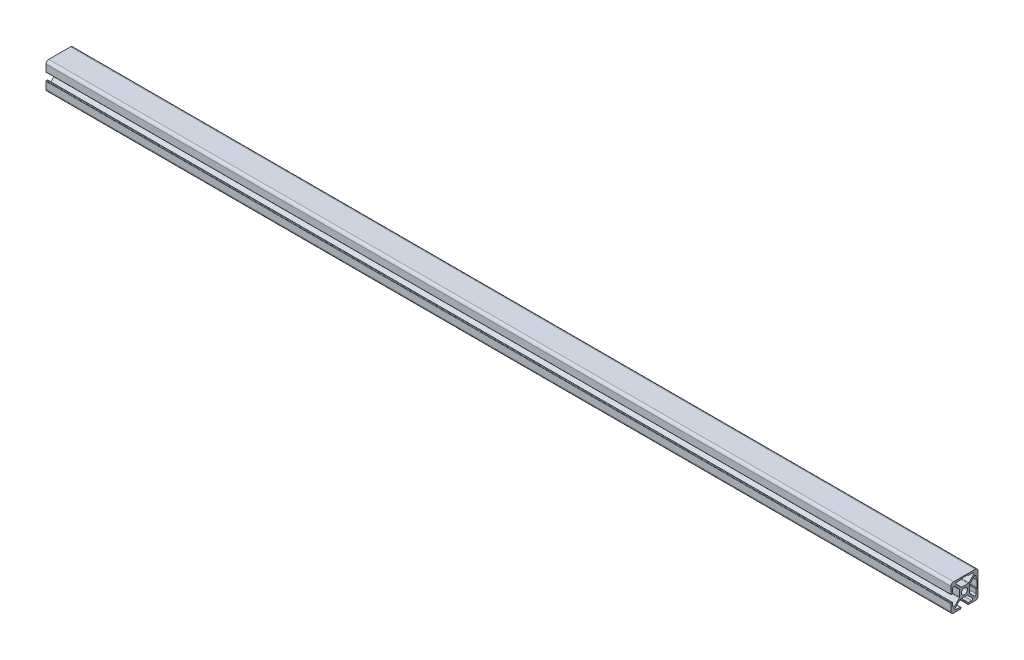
ISO-10303-21;
HEADER;
FILE_DESCRIPTION(('STEP AP214'),'2;1');
FILE_NAME('part.step','',(''),(''),'','','');
FILE_SCHEMA(('AUTOMOTIVE_DESIGN { 1 0 10303 214 1 1 1 1 }'));
ENDSEC;
DATA;
#1=APPLICATION_CONTEXT('core data for automotive mechanical design processes');
#2=APPLICATION_PROTOCOL_DEFINITION('international standard','automotive_design',2000,#1);
#3=PRODUCT_CONTEXT('',#1,'mechanical');
#4=PRODUCT('Part','Part','',(#3));
#5=PRODUCT_RELATED_PRODUCT_CATEGORY('part','',(#4));
#6=PRODUCT_DEFINITION_FORMATION('','',#4);
#7=PRODUCT_DEFINITION_CONTEXT('part definition',#1,'design');
#8=PRODUCT_DEFINITION('design','',#6,#7);
#9=PRODUCT_DEFINITION_SHAPE('','',#8);
#10=(LENGTH_UNIT() NAMED_UNIT(*) SI_UNIT(.MILLI.,.METRE.));
#11=(NAMED_UNIT(*) PLANE_ANGLE_UNIT() SI_UNIT($,.RADIAN.));
#12=(NAMED_UNIT(*) SI_UNIT($,.STERADIAN.) SOLID_ANGLE_UNIT());
#13=UNCERTAINTY_MEASURE_WITH_UNIT(LENGTH_MEASURE(1.E-05),#10,'distance_accuracy_value','');
#14=(GEOMETRIC_REPRESENTATION_CONTEXT(3) GLOBAL_UNCERTAINTY_ASSIGNED_CONTEXT((#13)) GLOBAL_UNIT_ASSIGNED_CONTEXT((#10,
#11,#12)) REPRESENTATION_CONTEXT('',''));
#15=CARTESIAN_POINT('',(0.,0.,0.));
#16=DIRECTION('',(0.,0.,1.));
#17=DIRECTION('',(1.,0.,0.));
#18=AXIS2_PLACEMENT_3D('',#15,#16,#17);
#19=CARTESIAN_POINT('',(1000.,4.49999999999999,14.5));
#20=DIRECTION('',(-1.,0.,0.));
#21=DIRECTION('',(0.,0.,1.));
#22=AXIS2_PLACEMENT_3D('',#19,#20,#21);
#23=CYLINDRICAL_SURFACE('',#22,0.5);
#24=CARTESIAN_POINT('',(0.,4.49999999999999,14.5));
#25=DIRECTION('',(1.,0.,0.));
#26=DIRECTION('',(0.,0.,-1.));
#27=AXIS2_PLACEMENT_3D('',#24,#25,#26);
#28=CIRCLE('',#27,0.5);
#29=CARTESIAN_POINT('',(0.,4.49999999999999,15.));
#30=VERTEX_POINT('',#29);
#31=CARTESIAN_POINT('',(0.,3.99999999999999,14.5));
#32=VERTEX_POINT('',#31);
#33=EDGE_CURVE('E709',#30,#32,#28,.T.);
#34=ORIENTED_EDGE('',*,*,#33,.T.);
#35=DIRECTION('',(-1.,0.,0.));
#36=VECTOR('',#35,1.);
#37=CARTESIAN_POINT('',(1000.,3.99999999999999,14.5));
#38=LINE('',#37,#36);
#39=CARTESIAN_POINT('',(1000.,3.99999999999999,14.5));
#40=VERTEX_POINT('',#39);
#41=EDGE_CURVE('E13',#40,#32,#38,.T.);
#42=ORIENTED_EDGE('',*,*,#41,.F.);
#43=CARTESIAN_POINT('',(1000.,4.49999999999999,14.5));
#44=DIRECTION('',(1.,0.,0.));
#45=DIRECTION('',(0.,0.,-1.));
#46=AXIS2_PLACEMENT_3D('',#43,#44,#45);
#47=CIRCLE('',#46,0.5);
#48=CARTESIAN_POINT('',(1000.,4.49999999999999,15.));
#49=VERTEX_POINT('',#48);
#50=EDGE_CURVE('E1049',#49,#40,#47,.T.);
#51=ORIENTED_EDGE('',*,*,#50,.F.);
#52=DIRECTION('',(-1.,0.,0.));
#53=VECTOR('',#52,1.);
#54=CARTESIAN_POINT('',(1000.,4.49999999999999,15.));
#55=LINE('',#54,#53);
#56=EDGE_CURVE('E788',#49,#30,#55,.T.);
#57=ORIENTED_EDGE('',*,*,#56,.T.);
#58=EDGE_LOOP('',(#34,#42,#51,#57));
#59=FACE_BOUND('',#58,.T.);
#60=ADVANCED_FACE('F162',(#59),#23,.T.);
#61=CARTESIAN_POINT('',(1000.,3.99999999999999,14.5));
#62=DIRECTION('',(0.,1.,0.));
#63=DIRECTION('',(0.,0.,1.));
#64=AXIS2_PLACEMENT_3D('',#61,#62,#63);
#65=PLANE('',#64);
#66=DIRECTION('',(0.,0.,-1.));
#67=VECTOR('',#66,1.);
#68=CARTESIAN_POINT('',(0.,3.99999999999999,14.5));
#69=LINE('',#68,#67);
#70=CARTESIAN_POINT('',(0.,4.,13.5));
#71=VERTEX_POINT('',#70);
#72=EDGE_CURVE('E712',#32,#71,#69,.T.);
#73=ORIENTED_EDGE('',*,*,#72,.T.);
#74=DIRECTION('',(-1.,0.,0.));
#75=VECTOR('',#74,1.);
#76=CARTESIAN_POINT('',(1000.,4.,13.5));
#77=LINE('',#76,#75);
#78=CARTESIAN_POINT('',(1000.,4.,13.5));
#79=VERTEX_POINT('',#78);
#80=EDGE_CURVE('E172',#79,#71,#77,.T.);
#81=ORIENTED_EDGE('',*,*,#80,.F.);
#82=DIRECTION('',(0.,0.,-1.));
#83=VECTOR('',#82,1.);
#84=CARTESIAN_POINT('',(1000.,3.99999999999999,14.5));
#85=LINE('',#84,#83);
#86=EDGE_CURVE('E1051',#40,#79,#85,.T.);
#87=ORIENTED_EDGE('',*,*,#86,.F.);
#88=ORIENTED_EDGE('',*,*,#41,.T.);
#89=EDGE_LOOP('',(#73,#81,#87,#88));
#90=FACE_BOUND('',#89,.T.);
#91=ADVANCED_FACE('F1150',(#90),#65,.F.);
#92=CARTESIAN_POINT('',(1000.,4.5,13.5));
#93=DIRECTION('',(-1.,0.,0.));
#94=DIRECTION('',(0.,0.,1.));
#95=AXIS2_PLACEMENT_3D('',#92,#93,#94);
#96=CYLINDRICAL_SURFACE('',#95,0.5);
#97=CARTESIAN_POINT('',(0.,4.5,13.5));
#98=DIRECTION('',(1.,0.,0.));
#99=DIRECTION('',(0.,0.,-1.));
#100=AXIS2_PLACEMENT_3D('',#97,#98,#99);
#101=CIRCLE('',#100,0.5);
#102=CARTESIAN_POINT('',(0.,4.5,13.));
#103=VERTEX_POINT('',#102);
#104=EDGE_CURVE('E714',#71,#103,#101,.T.);
#105=ORIENTED_EDGE('',*,*,#104,.T.);
#106=DIRECTION('',(-1.,0.,0.));
#107=VECTOR('',#106,1.);
#108=CARTESIAN_POINT('',(1000.,4.5,13.));
#109=LINE('',#108,#107);
#110=CARTESIAN_POINT('',(1000.,4.5,13.));
#111=VERTEX_POINT('',#110);
#112=EDGE_CURVE('E892',#111,#103,#109,.T.);
#113=ORIENTED_EDGE('',*,*,#112,.F.);
#114=CARTESIAN_POINT('',(1000.,4.5,13.5));
#115=DIRECTION('',(1.,0.,0.));
#116=DIRECTION('',(0.,0.,-1.));
#117=AXIS2_PLACEMENT_3D('',#114,#115,#116);
#118=CIRCLE('',#117,0.5);
#119=EDGE_CURVE('E1053',#79,#111,#118,.T.);
#120=ORIENTED_EDGE('',*,*,#119,.F.);
#121=ORIENTED_EDGE('',*,*,#80,.T.);
#122=EDGE_LOOP('',(#105,#113,#120,#121));
#123=FACE_BOUND('',#122,.T.);
#124=ADVANCED_FACE('F1155',(#123),#96,.T.);
#125=CARTESIAN_POINT('',(1000.,4.5,13.));
#126=DIRECTION('',(0.,0.,1.));
#127=DIRECTION('',(1.,0.,0.));
#128=AXIS2_PLACEMENT_3D('',#125,#126,#127);
#129=PLANE('',#128);
#130=DIRECTION('',(0.,1.,0.));
#131=VECTOR('',#130,1.);
#132=CARTESIAN_POINT('',(0.,4.5,13.));
#133=LINE('',#132,#131);
#134=CARTESIAN_POINT('',(0.,9.10225830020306,13.));
#135=VERTEX_POINT('',#134);
#136=EDGE_CURVE('E716',#103,#135,#133,.T.);
#137=ORIENTED_EDGE('',*,*,#136,.T.);
#138=DIRECTION('',(-1.,0.,0.));
#139=VECTOR('',#138,1.);
#140=CARTESIAN_POINT('',(1000.,9.10225830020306,13.));
#141=LINE('',#140,#139);
#142=CARTESIAN_POINT('',(1000.,9.10225830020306,13.));
#143=VERTEX_POINT('',#142);
#144=EDGE_CURVE('E889',#143,#135,#141,.T.);
#145=ORIENTED_EDGE('',*,*,#144,.F.);
#146=DIRECTION('',(0.,1.,0.));
#147=VECTOR('',#146,1.);
#148=CARTESIAN_POINT('',(1000.,4.5,13.));
#149=LINE('',#148,#147);
#150=EDGE_CURVE('E1055',#111,#143,#149,.T.);
#151=ORIENTED_EDGE('',*,*,#150,.F.);
#152=ORIENTED_EDGE('',*,*,#112,.T.);
#153=EDGE_LOOP('',(#137,#145,#151,#152));
#154=FACE_BOUND('',#153,.T.);
#155=ADVANCED_FACE('F1508',(#154),#129,.F.);
#156=CARTESIAN_POINT('',(1000.,9.10225830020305,11.702258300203));
#157=DIRECTION('',(-1.,0.,0.));
#158=DIRECTION('',(0.,0.,1.));
#159=AXIS2_PLACEMENT_3D('',#156,#157,#158);
#160=CYLINDRICAL_SURFACE('',#159,1.29774169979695);
#161=CARTESIAN_POINT('',(0.,9.10225830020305,11.702258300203));
#162=DIRECTION('',(-1.,0.,0.));
#163=DIRECTION('',(0.,0.,-1.));
#164=AXIS2_PLACEMENT_3D('',#161,#162,#163);
#165=CIRCLE('',#164,1.29774169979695);
#166=CARTESIAN_POINT('',(0.,10.019900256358,10.7846163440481));
#167=VERTEX_POINT('',#166);
#168=EDGE_CURVE('E718',#135,#167,#165,.T.);
#169=ORIENTED_EDGE('',*,*,#168,.T.);
#170=DIRECTION('',(-1.,0.,0.));
#171=VECTOR('',#170,1.);
#172=CARTESIAN_POINT('',(1000.,10.019900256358,10.7846163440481));
#173=LINE('',#172,#171);
#174=CARTESIAN_POINT('',(1000.,10.019900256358,10.7846163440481));
#175=VERTEX_POINT('',#174);
#176=EDGE_CURVE('E886',#175,#167,#173,.T.);
#177=ORIENTED_EDGE('',*,*,#176,.F.);
#178=CARTESIAN_POINT('',(1000.,9.10225830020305,11.702258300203));
#179=DIRECTION('',(-1.,0.,0.));
#180=DIRECTION('',(0.,0.,-1.));
#181=AXIS2_PLACEMENT_3D('',#178,#179,#180);
#182=CIRCLE('',#181,1.29774169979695);
#183=EDGE_CURVE('E1057',#143,#175,#182,.T.);
#184=ORIENTED_EDGE('',*,*,#183,.F.);
#185=ORIENTED_EDGE('',*,*,#144,.T.);
#186=EDGE_LOOP('',(#169,#177,#184,#185));
#187=FACE_BOUND('',#186,.T.);
#188=ADVANCED_FACE('F1517',(#187),#160,.F.);
#189=CARTESIAN_POINT('',(1000.,10.019900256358,10.7846163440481));
#190=DIRECTION('',(0.,0.707106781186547,-0.707106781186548));
#191=DIRECTION('',(0.,0.707106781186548,0.707106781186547));
#192=AXIS2_PLACEMENT_3D('',#189,#190,#191);
#193=PLANE('',#192);
#194=DIRECTION('',(0.,-0.707106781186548,-0.707106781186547));
#195=VECTOR('',#194,1.);
#196=CARTESIAN_POINT('',(0.,10.019900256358,10.7846163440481));
#197=LINE('',#196,#195);
#198=CARTESIAN_POINT('',(0.,4.92817713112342,5.69289321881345));
#199=VERTEX_POINT('',#198);
#200=EDGE_CURVE('E720',#167,#199,#197,.T.);
#201=ORIENTED_EDGE('',*,*,#200,.T.);
#202=DIRECTION('',(-1.,0.,0.));
#203=VECTOR('',#202,1.);
#204=CARTESIAN_POINT('',(1000.,4.92817713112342,5.69289321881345));
#205=LINE('',#204,#203);
#206=CARTESIAN_POINT('',(1000.,4.92817713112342,5.69289321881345));
#207=VERTEX_POINT('',#206);
#208=EDGE_CURVE('E883',#207,#199,#205,.T.);
#209=ORIENTED_EDGE('',*,*,#208,.F.);
#210=DIRECTION('',(0.,-0.707106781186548,-0.707106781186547));
#211=VECTOR('',#210,1.);
#212=CARTESIAN_POINT('',(1000.,10.019900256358,10.7846163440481));
#213=LINE('',#212,#211);
#214=EDGE_CURVE('E1059',#175,#207,#213,.T.);
#215=ORIENTED_EDGE('',*,*,#214,.F.);
#216=ORIENTED_EDGE('',*,*,#176,.T.);
#217=EDGE_LOOP('',(#201,#209,#215,#216));
#218=FACE_BOUND('',#217,.T.);
#219=ADVANCED_FACE('F1527',(#218),#193,.F.);
#220=CARTESIAN_POINT('',(1000.,4.22107034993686,6.39999999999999));
#221=DIRECTION('',(-1.,0.,0.));
#222=DIRECTION('',(0.,0.,1.));
#223=AXIS2_PLACEMENT_3D('',#220,#221,#222);
#224=CYLINDRICAL_SURFACE('',#223,1.);
#225=CARTESIAN_POINT('',(0.,4.22107034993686,6.39999999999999));
#226=DIRECTION('',(-1.,0.,0.));
#227=DIRECTION('',(0.,0.,-1.));
#228=AXIS2_PLACEMENT_3D('',#225,#226,#227);
#229=CIRCLE('',#228,1.);
#230=CARTESIAN_POINT('',(0.,4.22107034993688,5.39999999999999));
#231=VERTEX_POINT('',#230);
#232=EDGE_CURVE('E722',#199,#231,#229,.T.);
#233=ORIENTED_EDGE('',*,*,#232,.T.);
#234=DIRECTION('',(-1.,0.,0.));
#235=VECTOR('',#234,1.);
#236=CARTESIAN_POINT('',(1000.,4.22107034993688,5.39999999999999));
#237=LINE('',#236,#235);
#238=CARTESIAN_POINT('',(1000.,4.22107034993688,5.39999999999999));
#239=VERTEX_POINT('',#238);
#240=EDGE_CURVE('E880',#239,#231,#237,.T.);
#241=ORIENTED_EDGE('',*,*,#240,.F.);
#242=CARTESIAN_POINT('',(1000.,4.22107034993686,6.39999999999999));
#243=DIRECTION('',(-1.,0.,0.));
#244=DIRECTION('',(0.,0.,-1.));
#245=AXIS2_PLACEMENT_3D('',#242,#243,#244);
#246=CIRCLE('',#245,1.);
#247=EDGE_CURVE('E1061',#207,#239,#246,.T.);
#248=ORIENTED_EDGE('',*,*,#247,.F.);
#249=ORIENTED_EDGE('',*,*,#208,.T.);
#250=EDGE_LOOP('',(#233,#241,#248,#249));
#251=FACE_BOUND('',#250,.T.);
#252=ADVANCED_FACE('F1537',(#251),#224,.F.);
#253=CARTESIAN_POINT('',(1000.,4.22107034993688,5.39999999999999));
#254=DIRECTION('',(0.,0.,-1.));
#255=DIRECTION('',(0.,1.,0.));
#256=AXIS2_PLACEMENT_3D('',#253,#254,#255);
#257=PLANE('',#256);
#258=DIRECTION('',(0.,-1.,0.));
#259=VECTOR('',#258,1.);
#260=CARTESIAN_POINT('',(0.,4.22107034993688,5.39999999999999));
#261=LINE('',#260,#259);
#262=CARTESIAN_POINT('',(0.,-3.02107034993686,5.40000000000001));
#263=VERTEX_POINT('',#262);
#264=EDGE_CURVE('E724',#231,#263,#261,.T.);
#265=ORIENTED_EDGE('',*,*,#264,.T.);
#266=DIRECTION('',(-1.,0.,0.));
#267=VECTOR('',#266,1.);
#268=CARTESIAN_POINT('',(1000.,-3.02107034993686,5.40000000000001));
#269=LINE('',#268,#267);
#270=CARTESIAN_POINT('',(1000.,-3.02107034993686,5.40000000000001));
#271=VERTEX_POINT('',#270);
#272=EDGE_CURVE('E877',#271,#263,#269,.T.);
#273=ORIENTED_EDGE('',*,*,#272,.F.);
#274=DIRECTION('',(0.,-1.,0.));
#275=VECTOR('',#274,1.);
#276=CARTESIAN_POINT('',(1000.,4.22107034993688,5.39999999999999));
#277=LINE('',#276,#275);
#278=EDGE_CURVE('E1063',#239,#271,#277,.T.);
#279=ORIENTED_EDGE('',*,*,#278,.F.);
#280=ORIENTED_EDGE('',*,*,#240,.T.);
#281=EDGE_LOOP('',(#265,#273,#279,#280));
#282=FACE_BOUND('',#281,.T.);
#283=ADVANCED_FACE('F1547',(#282),#257,.F.);
#284=CARTESIAN_POINT('',(1000.,-3.02107034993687,6.39999999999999));
#285=DIRECTION('',(-1.,0.,0.));
#286=DIRECTION('',(0.,0.,1.));
#287=AXIS2_PLACEMENT_3D('',#284,#285,#286);
#288=CYLINDRICAL_SURFACE('',#287,0.999999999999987);
#289=CARTESIAN_POINT('',(0.,-3.02107034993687,6.39999999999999));
#290=DIRECTION('',(-1.,0.,0.));
#291=DIRECTION('',(0.,0.,-1.));
#292=AXIS2_PLACEMENT_3D('',#289,#290,#291);
#293=CIRCLE('',#292,0.999999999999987);
#294=CARTESIAN_POINT('',(0.,-3.7281771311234,5.69289321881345));
#295=VERTEX_POINT('',#294);
#296=EDGE_CURVE('E726',#263,#295,#293,.T.);
#297=ORIENTED_EDGE('',*,*,#296,.T.);
#298=DIRECTION('',(-1.,0.,0.));
#299=VECTOR('',#298,1.);
#300=CARTESIAN_POINT('',(1000.,-3.7281771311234,5.69289321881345));
#301=LINE('',#300,#299);
#302=CARTESIAN_POINT('',(1000.,-3.7281771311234,5.69289321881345));
#303=VERTEX_POINT('',#302);
#304=EDGE_CURVE('E874',#303,#295,#301,.T.);
#305=ORIENTED_EDGE('',*,*,#304,.F.);
#306=CARTESIAN_POINT('',(1000.,-3.02107034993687,6.39999999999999));
#307=DIRECTION('',(-1.,0.,0.));
#308=DIRECTION('',(0.,0.,-1.));
#309=AXIS2_PLACEMENT_3D('',#306,#307,#308);
#310=CIRCLE('',#309,0.999999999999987);
#311=EDGE_CURVE('E1065',#271,#303,#310,.T.);
#312=ORIENTED_EDGE('',*,*,#311,.F.);
#313=ORIENTED_EDGE('',*,*,#272,.T.);
#314=EDGE_LOOP('',(#297,#305,#312,#313));
#315=FACE_BOUND('',#314,.T.);
#316=ADVANCED_FACE('F1557',(#315),#288,.F.);
#317=CARTESIAN_POINT('',(1000.,-3.7281771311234,5.69289321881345));
#318=DIRECTION('',(0.,-0.707106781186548,-0.707106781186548));
#319=DIRECTION('',(0.,0.707106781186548,-0.707106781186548));
#320=AXIS2_PLACEMENT_3D('',#317,#318,#319);
#321=PLANE('',#320);
#322=DIRECTION('',(0.,-0.707106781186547,0.707106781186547));
#323=VECTOR('',#322,1.);
#324=CARTESIAN_POINT('',(0.,-3.7281771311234,5.69289321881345));
#325=LINE('',#324,#323);
#326=CARTESIAN_POINT('',(0.,-8.81990025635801,10.7846163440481));
#327=VERTEX_POINT('',#326);
#328=EDGE_CURVE('E728',#295,#327,#325,.T.);
#329=ORIENTED_EDGE('',*,*,#328,.T.);
#330=DIRECTION('',(-1.,0.,0.));
#331=VECTOR('',#330,1.);
#332=CARTESIAN_POINT('',(1000.,-8.81990025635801,10.7846163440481));
#333=LINE('',#332,#331);
#334=CARTESIAN_POINT('',(1000.,-8.81990025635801,10.7846163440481));
#335=VERTEX_POINT('',#334);
#336=EDGE_CURVE('E871',#335,#327,#333,.T.);
#337=ORIENTED_EDGE('',*,*,#336,.F.);
#338=DIRECTION('',(0.,-0.707106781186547,0.707106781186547));
#339=VECTOR('',#338,1.);
#340=CARTESIAN_POINT('',(1000.,-3.7281771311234,5.69289321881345));
#341=LINE('',#340,#339);
#342=EDGE_CURVE('E1067',#303,#335,#341,.T.);
#343=ORIENTED_EDGE('',*,*,#342,.F.);
#344=ORIENTED_EDGE('',*,*,#304,.T.);
#345=EDGE_LOOP('',(#329,#337,#343,#344));
#346=FACE_BOUND('',#345,.T.);
#347=ADVANCED_FACE('F1567',(#346),#321,.F.);
#348=CARTESIAN_POINT('',(1000.,-7.90225830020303,11.702258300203));
#349=DIRECTION('',(-1.,0.,0.));
#350=DIRECTION('',(0.,0.,1.));
#351=AXIS2_PLACEMENT_3D('',#348,#349,#350);
#352=CYLINDRICAL_SURFACE('',#351,1.29774169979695);
#353=CARTESIAN_POINT('',(0.,-7.90225830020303,11.702258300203));
#354=DIRECTION('',(-1.,0.,0.));
#355=DIRECTION('',(0.,0.,-1.));
#356=AXIS2_PLACEMENT_3D('',#353,#354,#355);
#357=CIRCLE('',#356,1.29774169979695);
#358=CARTESIAN_POINT('',(0.,-7.90225830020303,13.));
#359=VERTEX_POINT('',#358);
#360=EDGE_CURVE('E730',#327,#359,#357,.T.);
#361=ORIENTED_EDGE('',*,*,#360,.T.);
#362=DIRECTION('',(-1.,0.,0.));
#363=VECTOR('',#362,1.);
#364=CARTESIAN_POINT('',(1000.,-7.90225830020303,13.));
#365=LINE('',#364,#363);
#366=CARTESIAN_POINT('',(1000.,-7.90225830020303,13.));
#367=VERTEX_POINT('',#366);
#368=EDGE_CURVE('E868',#367,#359,#365,.T.);
#369=ORIENTED_EDGE('',*,*,#368,.F.);
#370=CARTESIAN_POINT('',(1000.,-7.90225830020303,11.702258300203));
#371=DIRECTION('',(-1.,0.,0.));
#372=DIRECTION('',(0.,0.,-1.));
#373=AXIS2_PLACEMENT_3D('',#370,#371,#372);
#374=CIRCLE('',#373,1.29774169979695);
#375=EDGE_CURVE('E1069',#335,#367,#374,.T.);
#376=ORIENTED_EDGE('',*,*,#375,.F.);
#377=ORIENTED_EDGE('',*,*,#336,.T.);
#378=EDGE_LOOP('',(#361,#369,#376,#377));
#379=FACE_BOUND('',#378,.T.);
#380=ADVANCED_FACE('F1577',(#379),#352,.F.);
#381=CARTESIAN_POINT('',(1000.,-7.90225830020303,13.));
#382=DIRECTION('',(0.,0.,1.));
#383=DIRECTION('',(0.,-1.,0.));
#384=AXIS2_PLACEMENT_3D('',#381,#382,#383);
#385=PLANE('',#384);
#386=DIRECTION('',(0.,1.,0.));
#387=VECTOR('',#386,1.);
#388=CARTESIAN_POINT('',(0.,-7.90225830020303,13.));
#389=LINE('',#388,#387);
#390=CARTESIAN_POINT('',(0.,-4.49999999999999,13.));
#391=VERTEX_POINT('',#390);
#392=EDGE_CURVE('E732',#359,#391,#389,.T.);
#393=ORIENTED_EDGE('',*,*,#392,.T.);
#394=DIRECTION('',(-1.,0.,0.));
#395=VECTOR('',#394,1.);
#396=CARTESIAN_POINT('',(1000.,-4.49999999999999,13.));
#397=LINE('',#396,#395);
#398=CARTESIAN_POINT('',(1000.,-4.49999999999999,13.));
#399=VERTEX_POINT('',#398);
#400=EDGE_CURVE('E865',#399,#391,#397,.T.);
#401=ORIENTED_EDGE('',*,*,#400,.F.);
#402=DIRECTION('',(0.,1.,0.));
#403=VECTOR('',#402,1.);
#404=CARTESIAN_POINT('',(1000.,-7.90225830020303,13.));
#405=LINE('',#404,#403);
#406=EDGE_CURVE('E1071',#367,#399,#405,.T.);
#407=ORIENTED_EDGE('',*,*,#406,.F.);
#408=ORIENTED_EDGE('',*,*,#368,.T.);
#409=EDGE_LOOP('',(#393,#401,#407,#408));
#410=FACE_BOUND('',#409,.T.);
#411=ADVANCED_FACE('F1587',(#410),#385,.F.);
#412=CARTESIAN_POINT('',(1000.,-4.49999999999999,13.5));
#413=DIRECTION('',(-1.,0.,0.));
#414=DIRECTION('',(0.,0.,1.));
#415=AXIS2_PLACEMENT_3D('',#412,#413,#414);
#416=CYLINDRICAL_SURFACE('',#415,0.5);
#417=CARTESIAN_POINT('',(0.,-4.49999999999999,13.5));
#418=DIRECTION('',(1.,0.,0.));
#419=DIRECTION('',(0.,0.,-1.));
#420=AXIS2_PLACEMENT_3D('',#417,#418,#419);
#421=CIRCLE('',#420,0.5);
#422=CARTESIAN_POINT('',(0.,-3.99999999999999,13.5));
#423=VERTEX_POINT('',#422);
#424=EDGE_CURVE('E734',#391,#423,#421,.T.);
#425=ORIENTED_EDGE('',*,*,#424,.T.);
#426=DIRECTION('',(-1.,0.,0.));
#427=VECTOR('',#426,1.);
#428=CARTESIAN_POINT('',(1000.,-3.99999999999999,13.5));
#429=LINE('',#428,#427);
#430=CARTESIAN_POINT('',(1000.,-3.99999999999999,13.5));
#431=VERTEX_POINT('',#430);
#432=EDGE_CURVE('E862',#431,#423,#429,.T.);
#433=ORIENTED_EDGE('',*,*,#432,.F.);
#434=CARTESIAN_POINT('',(1000.,-4.49999999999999,13.5));
#435=DIRECTION('',(1.,0.,0.));
#436=DIRECTION('',(0.,0.,-1.));
#437=AXIS2_PLACEMENT_3D('',#434,#435,#436);
#438=CIRCLE('',#437,0.5);
#439=EDGE_CURVE('E1073',#399,#431,#438,.T.);
#440=ORIENTED_EDGE('',*,*,#439,.F.);
#441=ORIENTED_EDGE('',*,*,#400,.T.);
#442=EDGE_LOOP('',(#425,#433,#440,#441));
#443=FACE_BOUND('',#442,.T.);
#444=ADVANCED_FACE('F1597',(#443),#416,.T.);
#445=CARTESIAN_POINT('',(1000.,-3.99999999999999,13.5));
#446=DIRECTION('',(0.,-1.,0.));
#447=DIRECTION('',(0.,0.,-1.));
#448=AXIS2_PLACEMENT_3D('',#445,#446,#447);
#449=PLANE('',#448);
#450=DIRECTION('',(0.,0.,1.));
#451=VECTOR('',#450,1.);
#452=CARTESIAN_POINT('',(0.,-3.99999999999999,13.5));
#453=LINE('',#452,#451);
#454=CARTESIAN_POINT('',(0.,-3.99999999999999,14.5));
#455=VERTEX_POINT('',#454);
#456=EDGE_CURVE('E736',#423,#455,#453,.T.);
#457=ORIENTED_EDGE('',*,*,#456,.T.);
#458=DIRECTION('',(-1.,0.,0.));
#459=VECTOR('',#458,1.);
#460=CARTESIAN_POINT('',(1000.,-3.99999999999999,14.5));
#461=LINE('',#460,#459);
#462=CARTESIAN_POINT('',(1000.,-3.99999999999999,14.5));
#463=VERTEX_POINT('',#462);
#464=EDGE_CURVE('E859',#463,#455,#461,.T.);
#465=ORIENTED_EDGE('',*,*,#464,.F.);
#466=DIRECTION('',(0.,0.,1.));
#467=VECTOR('',#466,1.);
#468=CARTESIAN_POINT('',(1000.,-3.99999999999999,13.5));
#469=LINE('',#468,#467);
#470=EDGE_CURVE('E1075',#431,#463,#469,.T.);
#471=ORIENTED_EDGE('',*,*,#470,.F.);
#472=ORIENTED_EDGE('',*,*,#432,.T.);
#473=EDGE_LOOP('',(#457,#465,#471,#472));
#474=FACE_BOUND('',#473,.T.);
#475=ADVANCED_FACE('F1607',(#474),#449,.F.);
#476=CARTESIAN_POINT('',(1000.,-4.49999999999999,14.5));
#477=DIRECTION('',(-1.,0.,0.));
#478=DIRECTION('',(0.,0.,1.));
#479=AXIS2_PLACEMENT_3D('',#476,#477,#478);
#480=CYLINDRICAL_SURFACE('',#479,0.5);
#481=CARTESIAN_POINT('',(0.,-4.49999999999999,14.5));
#482=DIRECTION('',(1.,0.,0.));
#483=DIRECTION('',(0.,0.,-1.));
#484=AXIS2_PLACEMENT_3D('',#481,#482,#483);
#485=CIRCLE('',#484,0.5);
#486=CARTESIAN_POINT('',(0.,-4.49999999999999,15.));
#487=VERTEX_POINT('',#486);
#488=EDGE_CURVE('E738',#455,#487,#485,.T.);
#489=ORIENTED_EDGE('',*,*,#488,.T.);
#490=DIRECTION('',(-1.,0.,0.));
#491=VECTOR('',#490,1.);
#492=CARTESIAN_POINT('',(1000.,-4.49999999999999,15.));
#493=LINE('',#492,#491);
#494=CARTESIAN_POINT('',(1000.,-4.49999999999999,15.));
#495=VERTEX_POINT('',#494);
#496=EDGE_CURVE('E856',#495,#487,#493,.T.);
#497=ORIENTED_EDGE('',*,*,#496,.F.);
#498=CARTESIAN_POINT('',(1000.,-4.49999999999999,14.5));
#499=DIRECTION('',(1.,0.,0.));
#500=DIRECTION('',(0.,0.,-1.));
#501=AXIS2_PLACEMENT_3D('',#498,#499,#500);
#502=CIRCLE('',#501,0.5);
#503=EDGE_CURVE('E1077',#463,#495,#502,.T.);
#504=ORIENTED_EDGE('',*,*,#503,.F.);
#505=ORIENTED_EDGE('',*,*,#464,.T.);
#506=EDGE_LOOP('',(#489,#497,#504,#505));
#507=FACE_BOUND('',#506,.T.);
#508=ADVANCED_FACE('F1617',(#507),#480,.T.);
#509=CARTESIAN_POINT('',(1000.,-4.49999999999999,15.));
#510=DIRECTION('',(0.,0.,-1.));
#511=DIRECTION('',(-1.,0.,0.));
#512=AXIS2_PLACEMENT_3D('',#509,#510,#511);
#513=PLANE('',#512);
#514=DIRECTION('',(0.,-1.,0.));
#515=VECTOR('',#514,1.);
#516=CARTESIAN_POINT('',(0.,-4.49999999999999,15.));
#517=LINE('',#516,#515);
#518=CARTESIAN_POINT('',(0.,-12.,15.));
#519=VERTEX_POINT('',#518);
#520=EDGE_CURVE('E740',#487,#519,#517,.T.);
#521=ORIENTED_EDGE('',*,*,#520,.T.);
#522=DIRECTION('',(-1.,0.,0.));
#523=VECTOR('',#522,1.);
#524=CARTESIAN_POINT('',(1000.,-12.,15.));
#525=LINE('',#524,#523);
#526=CARTESIAN_POINT('',(1000.,-12.,15.));
#527=VERTEX_POINT('',#526);
#528=EDGE_CURVE('E853',#527,#519,#525,.T.);
#529=ORIENTED_EDGE('',*,*,#528,.F.);
#530=DIRECTION('',(0.,-1.,0.));
#531=VECTOR('',#530,1.);
#532=CARTESIAN_POINT('',(1000.,-4.49999999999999,15.));
#533=LINE('',#532,#531);
#534=EDGE_CURVE('E1079',#495,#527,#533,.T.);
#535=ORIENTED_EDGE('',*,*,#534,.F.);
#536=ORIENTED_EDGE('',*,*,#496,.T.);
#537=EDGE_LOOP('',(#521,#529,#535,#536));
#538=FACE_BOUND('',#537,.T.);
#539=ADVANCED_FACE('F1627',(#538),#513,.F.);
#540=CARTESIAN_POINT('',(1000.,-12.,12.));
#541=DIRECTION('',(-1.,0.,0.));
#542=DIRECTION('',(0.,0.,1.));
#543=AXIS2_PLACEMENT_3D('',#540,#541,#542);
#544=CYLINDRICAL_SURFACE('',#543,3.);
#545=CARTESIAN_POINT('',(0.,-12.,12.));
#546=DIRECTION('',(1.,0.,0.));
#547=DIRECTION('',(0.,0.,-1.));
#548=AXIS2_PLACEMENT_3D('',#545,#546,#547);
#549=CIRCLE('',#548,3.);
#550=CARTESIAN_POINT('',(0.,-15.,12.));
#551=VERTEX_POINT('',#550);
#552=EDGE_CURVE('E742',#519,#551,#549,.T.);
#553=ORIENTED_EDGE('',*,*,#552,.T.);
#554=DIRECTION('',(-1.,0.,0.));
#555=VECTOR('',#554,1.);
#556=CARTESIAN_POINT('',(1000.,-15.,12.));
#557=LINE('',#556,#555);
#558=CARTESIAN_POINT('',(1000.,-15.,12.));
#559=VERTEX_POINT('',#558);
#560=EDGE_CURVE('E850',#559,#551,#557,.T.);
#561=ORIENTED_EDGE('',*,*,#560,.F.);
#562=CARTESIAN_POINT('',(1000.,-12.,12.));
#563=DIRECTION('',(1.,0.,0.));
#564=DIRECTION('',(0.,0.,-1.));
#565=AXIS2_PLACEMENT_3D('',#562,#563,#564);
#566=CIRCLE('',#565,3.);
#567=EDGE_CURVE('E1081',#527,#559,#566,.T.);
#568=ORIENTED_EDGE('',*,*,#567,.F.);
#569=ORIENTED_EDGE('',*,*,#528,.T.);
#570=EDGE_LOOP('',(#553,#561,#568,#569));
#571=FACE_BOUND('',#570,.T.);
#572=ADVANCED_FACE('F1637',(#571),#544,.T.);
#573=CARTESIAN_POINT('',(1000.,-15.,12.));
#574=DIRECTION('',(0.,1.,0.));
#575=DIRECTION('',(0.,0.,1.));
#576=AXIS2_PLACEMENT_3D('',#573,#574,#575);
#577=PLANE('',#576);
#578=DIRECTION('',(0.,0.,-1.));
#579=VECTOR('',#578,1.);
#580=CARTESIAN_POINT('',(0.,-15.,12.));
#581=LINE('',#580,#579);
#582=CARTESIAN_POINT('',(0.,-15.,4.5));
#583=VERTEX_POINT('',#582);
#584=EDGE_CURVE('E744',#551,#583,#581,.T.);
#585=ORIENTED_EDGE('',*,*,#584,.T.);
#586=DIRECTION('',(-1.,0.,0.));
#587=VECTOR('',#586,1.);
#588=CARTESIAN_POINT('',(1000.,-15.,4.5));
#589=LINE('',#588,#587);
#590=CARTESIAN_POINT('',(1000.,-15.,4.5));
#591=VERTEX_POINT('',#590);
#592=EDGE_CURVE('E847',#591,#583,#589,.T.);
#593=ORIENTED_EDGE('',*,*,#592,.F.);
#594=DIRECTION('',(0.,0.,-1.));
#595=VECTOR('',#594,1.);
#596=CARTESIAN_POINT('',(1000.,-15.,12.));
#597=LINE('',#596,#595);
#598=EDGE_CURVE('E1083',#559,#591,#597,.T.);
#599=ORIENTED_EDGE('',*,*,#598,.F.);
#600=ORIENTED_EDGE('',*,*,#560,.T.);
#601=EDGE_LOOP('',(#585,#593,#599,#600));
#602=FACE_BOUND('',#601,.T.);
#603=ADVANCED_FACE('F1647',(#602),#577,.F.);
#604=CARTESIAN_POINT('',(1000.,-14.5,4.5));
#605=DIRECTION('',(-1.,0.,0.));
#606=DIRECTION('',(0.,0.,1.));
#607=AXIS2_PLACEMENT_3D('',#604,#605,#606);
#608=CYLINDRICAL_SURFACE('',#607,0.5);
#609=CARTESIAN_POINT('',(0.,-14.5,4.5));
#610=DIRECTION('',(1.,0.,0.));
#611=DIRECTION('',(0.,0.,-1.));
#612=AXIS2_PLACEMENT_3D('',#609,#610,#611);
#613=CIRCLE('',#612,0.5);
#614=CARTESIAN_POINT('',(0.,-14.5,4.));
#615=VERTEX_POINT('',#614);
#616=EDGE_CURVE('E746',#583,#615,#613,.T.);
#617=ORIENTED_EDGE('',*,*,#616,.T.);
#618=DIRECTION('',(-1.,0.,0.));
#619=VECTOR('',#618,1.);
#620=CARTESIAN_POINT('',(1000.,-14.5,4.));
#621=LINE('',#620,#619);
#622=CARTESIAN_POINT('',(1000.,-14.5,4.));
#623=VERTEX_POINT('',#622);
#624=EDGE_CURVE('E844',#623,#615,#621,.T.);
#625=ORIENTED_EDGE('',*,*,#624,.F.);
#626=CARTESIAN_POINT('',(1000.,-14.5,4.5));
#627=DIRECTION('',(1.,0.,0.));
#628=DIRECTION('',(0.,0.,-1.));
#629=AXIS2_PLACEMENT_3D('',#626,#627,#628);
#630=CIRCLE('',#629,0.5);
#631=EDGE_CURVE('E1085',#591,#623,#630,.T.);
#632=ORIENTED_EDGE('',*,*,#631,.F.);
#633=ORIENTED_EDGE('',*,*,#592,.T.);
#634=EDGE_LOOP('',(#617,#625,#632,#633));
#635=FACE_BOUND('',#634,.T.);
#636=ADVANCED_FACE('F1657',(#635),#608,.T.);
#637=CARTESIAN_POINT('',(1000.,-14.5,4.));
#638=DIRECTION('',(0.,0.,1.));
#639=DIRECTION('',(1.,0.,0.));
#640=AXIS2_PLACEMENT_3D('',#637,#638,#639);
#641=PLANE('',#640);
#642=DIRECTION('',(0.,1.,0.));
#643=VECTOR('',#642,1.);
#644=CARTESIAN_POINT('',(0.,-14.5,4.));
#645=LINE('',#644,#643);
#646=CARTESIAN_POINT('',(0.,-13.5,4.));
#647=VERTEX_POINT('',#646);
#648=EDGE_CURVE('E748',#615,#647,#645,.T.);
#649=ORIENTED_EDGE('',*,*,#648,.T.);
#650=DIRECTION('',(-1.,0.,0.));
#651=VECTOR('',#650,1.);
#652=CARTESIAN_POINT('',(1000.,-13.5,4.));
#653=LINE('',#652,#651);
#654=CARTESIAN_POINT('',(1000.,-13.5,4.));
#655=VERTEX_POINT('',#654);
#656=EDGE_CURVE('E841',#655,#647,#653,.T.);
#657=ORIENTED_EDGE('',*,*,#656,.F.);
#658=DIRECTION('',(0.,1.,0.));
#659=VECTOR('',#658,1.);
#660=CARTESIAN_POINT('',(1000.,-14.5,4.));
#661=LINE('',#660,#659);
#662=EDGE_CURVE('E1087',#623,#655,#661,.T.);
#663=ORIENTED_EDGE('',*,*,#662,.F.);
#664=ORIENTED_EDGE('',*,*,#624,.T.);
#665=EDGE_LOOP('',(#649,#657,#663,#664));
#666=FACE_BOUND('',#665,.T.);
#667=ADVANCED_FACE('F1667',(#666),#641,.F.);
#668=CARTESIAN_POINT('',(1000.,-13.5,4.5));
#669=DIRECTION('',(-1.,0.,0.));
#670=DIRECTION('',(0.,0.,1.));
#671=AXIS2_PLACEMENT_3D('',#668,#669,#670);
#672=CYLINDRICAL_SURFACE('',#671,0.5);
#673=CARTESIAN_POINT('',(0.,-13.5,4.5));
#674=DIRECTION('',(1.,0.,0.));
#675=DIRECTION('',(0.,0.,-1.));
#676=AXIS2_PLACEMENT_3D('',#673,#674,#675);
#677=CIRCLE('',#676,0.5);
#678=CARTESIAN_POINT('',(0.,-13.,4.5));
#679=VERTEX_POINT('',#678);
#680=EDGE_CURVE('E750',#647,#679,#677,.T.);
#681=ORIENTED_EDGE('',*,*,#680,.T.);
#682=DIRECTION('',(-1.,0.,0.));
#683=VECTOR('',#682,1.);
#684=CARTESIAN_POINT('',(1000.,-13.,4.5));
#685=LINE('',#684,#683);
#686=CARTESIAN_POINT('',(1000.,-13.,4.5));
#687=VERTEX_POINT('',#686);
#688=EDGE_CURVE('E838',#687,#679,#685,.T.);
#689=ORIENTED_EDGE('',*,*,#688,.F.);
#690=CARTESIAN_POINT('',(1000.,-13.5,4.5));
#691=DIRECTION('',(1.,0.,0.));
#692=DIRECTION('',(0.,0.,-1.));
#693=AXIS2_PLACEMENT_3D('',#690,#691,#692);
#694=CIRCLE('',#693,0.5);
#695=EDGE_CURVE('E1089',#655,#687,#694,.T.);
#696=ORIENTED_EDGE('',*,*,#695,.F.);
#697=ORIENTED_EDGE('',*,*,#656,.T.);
#698=EDGE_LOOP('',(#681,#689,#696,#697));
#699=FACE_BOUND('',#698,.T.);
#700=ADVANCED_FACE('F1677',(#699),#672,.T.);
#701=CARTESIAN_POINT('',(1000.,-13.,4.5));
#702=DIRECTION('',(0.,-1.,0.));
#703=DIRECTION('',(0.,0.,-1.));
#704=AXIS2_PLACEMENT_3D('',#701,#702,#703);
#705=PLANE('',#704);
#706=DIRECTION('',(0.,0.,1.));
#707=VECTOR('',#706,1.);
#708=CARTESIAN_POINT('',(0.,-13.,4.5));
#709=LINE('',#708,#707);
#710=CARTESIAN_POINT('',(0.,-13.,9.10225830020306));
#711=VERTEX_POINT('',#710);
#712=EDGE_CURVE('E752',#679,#711,#709,.T.);
#713=ORIENTED_EDGE('',*,*,#712,.T.);
#714=DIRECTION('',(-1.,0.,0.));
#715=VECTOR('',#714,1.);
#716=CARTESIAN_POINT('',(1000.,-13.,9.10225830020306));
#717=LINE('',#716,#715);
#718=CARTESIAN_POINT('',(1000.,-13.,9.10225830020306));
#719=VERTEX_POINT('',#718);
#720=EDGE_CURVE('E835',#719,#711,#717,.T.);
#721=ORIENTED_EDGE('',*,*,#720,.F.);
#722=DIRECTION('',(0.,0.,1.));
#723=VECTOR('',#722,1.);
#724=CARTESIAN_POINT('',(1000.,-13.,4.5));
#725=LINE('',#724,#723);
#726=EDGE_CURVE('E1091',#687,#719,#725,.T.);
#727=ORIENTED_EDGE('',*,*,#726,.F.);
#728=ORIENTED_EDGE('',*,*,#688,.T.);
#729=EDGE_LOOP('',(#713,#721,#727,#728));
#730=FACE_BOUND('',#729,.T.);
#731=ADVANCED_FACE('F1687',(#730),#705,.F.);
#732=CARTESIAN_POINT('',(1000.,-11.702258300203,9.10225830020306));
#733=DIRECTION('',(-1.,0.,0.));
#734=DIRECTION('',(0.,0.,1.));
#735=AXIS2_PLACEMENT_3D('',#732,#733,#734);
#736=CYLINDRICAL_SURFACE('',#735,1.29774169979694);
#737=CARTESIAN_POINT('',(0.,-11.702258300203,9.10225830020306));
#738=DIRECTION('',(-1.,0.,0.));
#739=DIRECTION('',(0.,0.,-1.));
#740=AXIS2_PLACEMENT_3D('',#737,#738,#739);
#741=CIRCLE('',#740,1.29774169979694);
#742=CARTESIAN_POINT('',(0.,-10.784616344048,10.019900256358));
#743=VERTEX_POINT('',#742);
#744=EDGE_CURVE('E754',#711,#743,#741,.T.);
#745=ORIENTED_EDGE('',*,*,#744,.T.);
#746=DIRECTION('',(-1.,0.,0.));
#747=VECTOR('',#746,1.);
#748=CARTESIAN_POINT('',(1000.,-10.784616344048,10.019900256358));
#749=LINE('',#748,#747);
#750=CARTESIAN_POINT('',(1000.,-10.784616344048,10.019900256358));
#751=VERTEX_POINT('',#750);
#752=EDGE_CURVE('E832',#751,#743,#749,.T.);
#753=ORIENTED_EDGE('',*,*,#752,.F.);
#754=CARTESIAN_POINT('',(1000.,-11.702258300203,9.10225830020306));
#755=DIRECTION('',(-1.,0.,0.));
#756=DIRECTION('',(0.,0.,-1.));
#757=AXIS2_PLACEMENT_3D('',#754,#755,#756);
#758=CIRCLE('',#757,1.29774169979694);
#759=EDGE_CURVE('E1093',#719,#751,#758,.T.);
#760=ORIENTED_EDGE('',*,*,#759,.F.);
#761=ORIENTED_EDGE('',*,*,#720,.T.);
#762=EDGE_LOOP('',(#745,#753,#760,#761));
#763=FACE_BOUND('',#762,.T.);
#764=ADVANCED_FACE('F1697',(#763),#736,.F.);
#765=CARTESIAN_POINT('',(1000.,-10.784616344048,10.019900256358));
#766=DIRECTION('',(0.,0.707106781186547,0.707106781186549));
#767=DIRECTION('',(0.,-0.707106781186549,0.707106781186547));
#768=AXIS2_PLACEMENT_3D('',#765,#766,#767);
#769=PLANE('',#768);
#770=DIRECTION('',(0.,0.707106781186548,-0.707106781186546));
#771=VECTOR('',#770,1.);
#772=CARTESIAN_POINT('',(0.,-10.784616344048,10.019900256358));
#773=LINE('',#772,#771);
#774=CARTESIAN_POINT('',(0.,-5.69289321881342,4.92817713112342));
#775=VERTEX_POINT('',#774);
#776=EDGE_CURVE('E756',#743,#775,#773,.T.);
#777=ORIENTED_EDGE('',*,*,#776,.T.);
#778=DIRECTION('',(-1.,0.,0.));
#779=VECTOR('',#778,1.);
#780=CARTESIAN_POINT('',(1000.,-5.69289321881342,4.92817713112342));
#781=LINE('',#780,#779);
#782=CARTESIAN_POINT('',(1000.,-5.69289321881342,4.92817713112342));
#783=VERTEX_POINT('',#782);
#784=EDGE_CURVE('E829',#783,#775,#781,.T.);
#785=ORIENTED_EDGE('',*,*,#784,.F.);
#786=DIRECTION('',(0.,0.707106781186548,-0.707106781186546));
#787=VECTOR('',#786,1.);
#788=CARTESIAN_POINT('',(1000.,-10.784616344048,10.019900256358));
#789=LINE('',#788,#787);
#790=EDGE_CURVE('E1095',#751,#783,#789,.T.);
#791=ORIENTED_EDGE('',*,*,#790,.F.);
#792=ORIENTED_EDGE('',*,*,#752,.T.);
#793=EDGE_LOOP('',(#777,#785,#791,#792));
#794=FACE_BOUND('',#793,.T.);
#795=ADVANCED_FACE('F1707',(#794),#769,.F.);
#796=CARTESIAN_POINT('',(1000.,-6.39999999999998,4.22107034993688));
#797=DIRECTION('',(-1.,0.,0.));
#798=DIRECTION('',(0.,0.,1.));
#799=AXIS2_PLACEMENT_3D('',#796,#797,#798);
#800=CYLINDRICAL_SURFACE('',#799,0.999999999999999);
#801=CARTESIAN_POINT('',(0.,-6.39999999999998,4.22107034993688));
#802=DIRECTION('',(-1.,0.,0.));
#803=DIRECTION('',(0.,0.,-1.));
#804=AXIS2_PLACEMENT_3D('',#801,#802,#803);
#805=CIRCLE('',#804,0.999999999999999);
#806=CARTESIAN_POINT('',(0.,-5.39999999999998,4.22107034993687));
#807=VERTEX_POINT('',#806);
#808=EDGE_CURVE('E758',#775,#807,#805,.T.);
#809=ORIENTED_EDGE('',*,*,#808,.T.);
#810=DIRECTION('',(-1.,0.,0.));
#811=VECTOR('',#810,1.);
#812=CARTESIAN_POINT('',(1000.,-5.39999999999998,4.22107034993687));
#813=LINE('',#812,#811);
#814=CARTESIAN_POINT('',(1000.,-5.39999999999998,4.22107034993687));
#815=VERTEX_POINT('',#814);
#816=EDGE_CURVE('E826',#815,#807,#813,.T.);
#817=ORIENTED_EDGE('',*,*,#816,.F.);
#818=CARTESIAN_POINT('',(1000.,-6.39999999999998,4.22107034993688));
#819=DIRECTION('',(-1.,0.,0.));
#820=DIRECTION('',(0.,0.,-1.));
#821=AXIS2_PLACEMENT_3D('',#818,#819,#820);
#822=CIRCLE('',#821,0.999999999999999);
#823=EDGE_CURVE('E1097',#783,#815,#822,.T.);
#824=ORIENTED_EDGE('',*,*,#823,.F.);
#825=ORIENTED_EDGE('',*,*,#784,.T.);
#826=EDGE_LOOP('',(#809,#817,#824,#825));
#827=FACE_BOUND('',#826,.T.);
#828=ADVANCED_FACE('F1717',(#827),#800,.F.);
#829=CARTESIAN_POINT('',(1000.,-5.39999999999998,4.22107034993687));
#830=DIRECTION('',(0.,1.,0.));
#831=DIRECTION('',(0.,0.,1.));
#832=AXIS2_PLACEMENT_3D('',#829,#830,#831);
#833=PLANE('',#832);
#834=DIRECTION('',(0.,0.,-1.));
#835=VECTOR('',#834,1.);
#836=CARTESIAN_POINT('',(0.,-5.39999999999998,4.22107034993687));
#837=LINE('',#836,#835);
#838=CARTESIAN_POINT('',(0.,-5.39999999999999,-3.02107034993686));
#839=VERTEX_POINT('',#838);
#840=EDGE_CURVE('E760',#807,#839,#837,.T.);
#841=ORIENTED_EDGE('',*,*,#840,.T.);
#842=DIRECTION('',(-1.,0.,0.));
#843=VECTOR('',#842,1.);
#844=CARTESIAN_POINT('',(1000.,-5.39999999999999,-3.02107034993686));
#845=LINE('',#844,#843);
#846=CARTESIAN_POINT('',(1000.,-5.39999999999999,-3.02107034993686));
#847=VERTEX_POINT('',#846);
#848=EDGE_CURVE('E823',#847,#839,#845,.T.);
#849=ORIENTED_EDGE('',*,*,#848,.F.);
#850=DIRECTION('',(0.,0.,-1.));
#851=VECTOR('',#850,1.);
#852=CARTESIAN_POINT('',(1000.,-5.39999999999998,4.22107034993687));
#853=LINE('',#852,#851);
#854=EDGE_CURVE('E1099',#815,#847,#853,.T.);
#855=ORIENTED_EDGE('',*,*,#854,.F.);
#856=ORIENTED_EDGE('',*,*,#816,.T.);
#857=EDGE_LOOP('',(#841,#849,#855,#856));
#858=FACE_BOUND('',#857,.T.);
#859=ADVANCED_FACE('F1727',(#858),#833,.F.);
#860=CARTESIAN_POINT('',(1000.,-6.39999999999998,-3.02107034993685));
#861=DIRECTION('',(-1.,0.,0.));
#862=DIRECTION('',(0.,0.,1.));
#863=AXIS2_PLACEMENT_3D('',#860,#861,#862);
#864=CYLINDRICAL_SURFACE('',#863,0.999999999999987);
#865=CARTESIAN_POINT('',(0.,-6.39999999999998,-3.02107034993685));
#866=DIRECTION('',(-1.,0.,0.));
#867=DIRECTION('',(0.,0.,-1.));
#868=AXIS2_PLACEMENT_3D('',#865,#866,#867);
#869=CIRCLE('',#868,0.999999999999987);
#870=CARTESIAN_POINT('',(0.,-5.69289321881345,-3.7281771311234));
#871=VERTEX_POINT('',#870);
#872=EDGE_CURVE('E762',#839,#871,#869,.T.);
#873=ORIENTED_EDGE('',*,*,#872,.T.);
#874=DIRECTION('',(-1.,0.,0.));
#875=VECTOR('',#874,1.);
#876=CARTESIAN_POINT('',(1000.,-5.69289321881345,-3.7281771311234));
#877=LINE('',#876,#875);
#878=CARTESIAN_POINT('',(1000.,-5.69289321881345,-3.7281771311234));
#879=VERTEX_POINT('',#878);
#880=EDGE_CURVE('E820',#879,#871,#877,.T.);
#881=ORIENTED_EDGE('',*,*,#880,.F.);
#882=CARTESIAN_POINT('',(1000.,-6.39999999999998,-3.02107034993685));
#883=DIRECTION('',(-1.,0.,0.));
#884=DIRECTION('',(0.,0.,-1.));
#885=AXIS2_PLACEMENT_3D('',#882,#883,#884);
#886=CIRCLE('',#885,0.999999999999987);
#887=EDGE_CURVE('E1101',#847,#879,#886,.T.);
#888=ORIENTED_EDGE('',*,*,#887,.F.);
#889=ORIENTED_EDGE('',*,*,#848,.T.);
#890=EDGE_LOOP('',(#873,#881,#888,#889));
#891=FACE_BOUND('',#890,.T.);
#892=ADVANCED_FACE('F1737',(#891),#864,.F.);
#893=CARTESIAN_POINT('',(1000.,-5.69289321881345,-3.7281771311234));
#894=DIRECTION('',(0.,0.707106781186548,-0.707106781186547));
#895=DIRECTION('',(0.,0.707106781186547,0.707106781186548));
#896=AXIS2_PLACEMENT_3D('',#893,#894,#895);
#897=PLANE('',#896);
#898=DIRECTION('',(0.,-0.707106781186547,-0.707106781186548));
#899=VECTOR('',#898,1.);
#900=CARTESIAN_POINT('',(0.,-5.69289321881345,-3.7281771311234));
#901=LINE('',#900,#899);
#902=CARTESIAN_POINT('',(0.,-10.784616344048,-8.81990025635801));
#903=VERTEX_POINT('',#902);
#904=EDGE_CURVE('E764',#871,#903,#901,.T.);
#905=ORIENTED_EDGE('',*,*,#904,.T.);
#906=DIRECTION('',(-1.,0.,0.));
#907=VECTOR('',#906,1.);
#908=CARTESIAN_POINT('',(1000.,-10.784616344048,-8.81990025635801));
#909=LINE('',#908,#907);
#910=CARTESIAN_POINT('',(1000.,-10.784616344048,-8.81990025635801));
#911=VERTEX_POINT('',#910);
#912=EDGE_CURVE('E817',#911,#903,#909,.T.);
#913=ORIENTED_EDGE('',*,*,#912,.F.);
#914=DIRECTION('',(0.,-0.707106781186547,-0.707106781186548));
#915=VECTOR('',#914,1.);
#916=CARTESIAN_POINT('',(1000.,-5.69289321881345,-3.7281771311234));
#917=LINE('',#916,#915);
#918=EDGE_CURVE('E1103',#879,#911,#917,.T.);
#919=ORIENTED_EDGE('',*,*,#918,.F.);
#920=ORIENTED_EDGE('',*,*,#880,.T.);
#921=EDGE_LOOP('',(#905,#913,#919,#920));
#922=FACE_BOUND('',#921,.T.);
#923=ADVANCED_FACE('F1747',(#922),#897,.F.);
#924=CARTESIAN_POINT('',(1000.,-11.702258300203,-7.90225830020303));
#925=DIRECTION('',(-1.,0.,0.));
#926=DIRECTION('',(0.,0.,1.));
#927=AXIS2_PLACEMENT_3D('',#924,#925,#926);
#928=CYLINDRICAL_SURFACE('',#927,1.29774169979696);
#929=CARTESIAN_POINT('',(0.,-11.702258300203,-7.90225830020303));
#930=DIRECTION('',(-1.,0.,0.));
#931=DIRECTION('',(0.,0.,-1.));
#932=AXIS2_PLACEMENT_3D('',#929,#930,#931);
#933=CIRCLE('',#932,1.29774169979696);
#934=CARTESIAN_POINT('',(0.,-13.,-7.90225830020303));
#935=VERTEX_POINT('',#934);
#936=EDGE_CURVE('E766',#903,#935,#933,.T.);
#937=ORIENTED_EDGE('',*,*,#936,.T.);
#938=DIRECTION('',(-1.,0.,0.));
#939=VECTOR('',#938,1.);
#940=CARTESIAN_POINT('',(1000.,-13.,-7.90225830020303));
#941=LINE('',#940,#939);
#942=CARTESIAN_POINT('',(1000.,-13.,-7.90225830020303));
#943=VERTEX_POINT('',#942);
#944=EDGE_CURVE('E814',#943,#935,#941,.T.);
#945=ORIENTED_EDGE('',*,*,#944,.F.);
#946=CARTESIAN_POINT('',(1000.,-11.702258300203,-7.90225830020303));
#947=DIRECTION('',(-1.,0.,0.));
#948=DIRECTION('',(0.,0.,-1.));
#949=AXIS2_PLACEMENT_3D('',#946,#947,#948);
#950=CIRCLE('',#949,1.29774169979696);
#951=EDGE_CURVE('E1105',#911,#943,#950,.T.);
#952=ORIENTED_EDGE('',*,*,#951,.F.);
#953=ORIENTED_EDGE('',*,*,#912,.T.);
#954=EDGE_LOOP('',(#937,#945,#952,#953));
#955=FACE_BOUND('',#954,.T.);
#956=ADVANCED_FACE('F1757',(#955),#928,.F.);
#957=CARTESIAN_POINT('',(1000.,-13.,-7.90225830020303));
#958=DIRECTION('',(0.,-1.,0.));
#959=DIRECTION('',(0.,0.,-1.));
#960=AXIS2_PLACEMENT_3D('',#957,#958,#959);
#961=PLANE('',#960);
#962=DIRECTION('',(0.,0.,1.));
#963=VECTOR('',#962,1.);
#964=CARTESIAN_POINT('',(0.,-13.,-7.90225830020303));
#965=LINE('',#964,#963);
#966=CARTESIAN_POINT('',(0.,-13.,-4.49999999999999));
#967=VERTEX_POINT('',#966);
#968=EDGE_CURVE('E768',#935,#967,#965,.T.);
#969=ORIENTED_EDGE('',*,*,#968,.T.);
#970=DIRECTION('',(-1.,0.,0.));
#971=VECTOR('',#970,1.);
#972=CARTESIAN_POINT('',(1000.,-13.,-4.49999999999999));
#973=LINE('',#972,#971);
#974=CARTESIAN_POINT('',(1000.,-13.,-4.49999999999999));
#975=VERTEX_POINT('',#974);
#976=EDGE_CURVE('E811',#975,#967,#973,.T.);
#977=ORIENTED_EDGE('',*,*,#976,.F.);
#978=DIRECTION('',(0.,0.,1.));
#979=VECTOR('',#978,1.);
#980=CARTESIAN_POINT('',(1000.,-13.,-7.90225830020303));
#981=LINE('',#980,#979);
#982=EDGE_CURVE('E1107',#943,#975,#981,.T.);
#983=ORIENTED_EDGE('',*,*,#982,.F.);
#984=ORIENTED_EDGE('',*,*,#944,.T.);
#985=EDGE_LOOP('',(#969,#977,#983,#984));
#986=FACE_BOUND('',#985,.T.);
#987=ADVANCED_FACE('F1767',(#986),#961,.F.);
#988=CARTESIAN_POINT('',(1000.,-13.5,-4.49999999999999));
#989=DIRECTION('',(-1.,0.,0.));
#990=DIRECTION('',(0.,0.,1.));
#991=AXIS2_PLACEMENT_3D('',#988,#989,#990);
#992=CYLINDRICAL_SURFACE('',#991,0.5);
#993=CARTESIAN_POINT('',(0.,-13.5,-4.49999999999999));
#994=DIRECTION('',(1.,0.,0.));
#995=DIRECTION('',(0.,0.,-1.));
#996=AXIS2_PLACEMENT_3D('',#993,#994,#995);
#997=CIRCLE('',#996,0.5);
#998=CARTESIAN_POINT('',(0.,-13.5,-3.99999999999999));
#999=VERTEX_POINT('',#998);
#1000=EDGE_CURVE('E770',#967,#999,#997,.T.);
#1001=ORIENTED_EDGE('',*,*,#1000,.T.);
#1002=DIRECTION('',(-1.,0.,0.));
#1003=VECTOR('',#1002,1.);
#1004=CARTESIAN_POINT('',(1000.,-13.5,-3.99999999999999));
#1005=LINE('',#1004,#1003);
#1006=CARTESIAN_POINT('',(1000.,-13.5,-3.99999999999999));
#1007=VERTEX_POINT('',#1006);
#1008=EDGE_CURVE('E808',#1007,#999,#1005,.T.);
#1009=ORIENTED_EDGE('',*,*,#1008,.F.);
#1010=CARTESIAN_POINT('',(1000.,-13.5,-4.49999999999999));
#1011=DIRECTION('',(1.,0.,0.));
#1012=DIRECTION('',(0.,0.,-1.));
#1013=AXIS2_PLACEMENT_3D('',#1010,#1011,#1012);
#1014=CIRCLE('',#1013,0.5);
#1015=EDGE_CURVE('E1109',#975,#1007,#1014,.T.);
#1016=ORIENTED_EDGE('',*,*,#1015,.F.);
#1017=ORIENTED_EDGE('',*,*,#976,.T.);
#1018=EDGE_LOOP('',(#1001,#1009,#1016,#1017));
#1019=FACE_BOUND('',#1018,.T.);
#1020=ADVANCED_FACE('F1777',(#1019),#992,.T.);
#1021=CARTESIAN_POINT('',(1000.,-13.5,-3.99999999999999));
#1022=DIRECTION('',(0.,0.,-1.));
#1023=DIRECTION('',(-1.,0.,0.));
#1024=AXIS2_PLACEMENT_3D('',#1021,#1022,#1023);
#1025=PLANE('',#1024);
#1026=DIRECTION('',(0.,-1.,0.));
#1027=VECTOR('',#1026,1.);
#1028=CARTESIAN_POINT('',(0.,-13.5,-3.99999999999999));
#1029=LINE('',#1028,#1027);
#1030=CARTESIAN_POINT('',(0.,-14.5,-3.99999999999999));
#1031=VERTEX_POINT('',#1030);
#1032=EDGE_CURVE('E772',#999,#1031,#1029,.T.);
#1033=ORIENTED_EDGE('',*,*,#1032,.T.);
#1034=DIRECTION('',(-1.,0.,0.));
#1035=VECTOR('',#1034,1.);
#1036=CARTESIAN_POINT('',(1000.,-14.5,-3.99999999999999));
#1037=LINE('',#1036,#1035);
#1038=CARTESIAN_POINT('',(1000.,-14.5,-3.99999999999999));
#1039=VERTEX_POINT('',#1038);
#1040=EDGE_CURVE('E805',#1039,#1031,#1037,.T.);
#1041=ORIENTED_EDGE('',*,*,#1040,.F.);
#1042=DIRECTION('',(0.,-1.,0.));
#1043=VECTOR('',#1042,1.);
#1044=CARTESIAN_POINT('',(1000.,-13.5,-3.99999999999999));
#1045=LINE('',#1044,#1043);
#1046=EDGE_CURVE('E1111',#1007,#1039,#1045,.T.);
#1047=ORIENTED_EDGE('',*,*,#1046,.F.);
#1048=ORIENTED_EDGE('',*,*,#1008,.T.);
#1049=EDGE_LOOP('',(#1033,#1041,#1047,#1048));
#1050=FACE_BOUND('',#1049,.T.);
#1051=ADVANCED_FACE('F1787',(#1050),#1025,.F.);
#1052=CARTESIAN_POINT('',(1000.,-14.5,-4.49999999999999));
#1053=DIRECTION('',(-1.,0.,0.));
#1054=DIRECTION('',(0.,0.,1.));
#1055=AXIS2_PLACEMENT_3D('',#1052,#1053,#1054);
#1056=CYLINDRICAL_SURFACE('',#1055,0.5);
#1057=CARTESIAN_POINT('',(0.,-14.5,-4.49999999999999));
#1058=DIRECTION('',(1.,0.,0.));
#1059=DIRECTION('',(0.,0.,-1.));
#1060=AXIS2_PLACEMENT_3D('',#1057,#1058,#1059);
#1061=CIRCLE('',#1060,0.5);
#1062=CARTESIAN_POINT('',(0.,-15.,-4.49999999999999));
#1063=VERTEX_POINT('',#1062);
#1064=EDGE_CURVE('E774',#1031,#1063,#1061,.T.);
#1065=ORIENTED_EDGE('',*,*,#1064,.T.);
#1066=DIRECTION('',(-1.,0.,0.));
#1067=VECTOR('',#1066,1.);
#1068=CARTESIAN_POINT('',(1000.,-15.,-4.49999999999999));
#1069=LINE('',#1068,#1067);
#1070=CARTESIAN_POINT('',(1000.,-15.,-4.49999999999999));
#1071=VERTEX_POINT('',#1070);
#1072=EDGE_CURVE('E802',#1071,#1063,#1069,.T.);
#1073=ORIENTED_EDGE('',*,*,#1072,.F.);
#1074=CARTESIAN_POINT('',(1000.,-14.5,-4.49999999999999));
#1075=DIRECTION('',(1.,0.,0.));
#1076=DIRECTION('',(0.,0.,-1.));
#1077=AXIS2_PLACEMENT_3D('',#1074,#1075,#1076);
#1078=CIRCLE('',#1077,0.5);
#1079=EDGE_CURVE('E1113',#1039,#1071,#1078,.T.);
#1080=ORIENTED_EDGE('',*,*,#1079,.F.);
#1081=ORIENTED_EDGE('',*,*,#1040,.T.);
#1082=EDGE_LOOP('',(#1065,#1073,#1080,#1081));
#1083=FACE_BOUND('',#1082,.T.);
#1084=ADVANCED_FACE('F1797',(#1083),#1056,.T.);
#1085=CARTESIAN_POINT('',(1000.,-15.,-4.49999999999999));
#1086=DIRECTION('',(0.,1.,0.));
#1087=DIRECTION('',(0.,0.,1.));
#1088=AXIS2_PLACEMENT_3D('',#1085,#1086,#1087);
#1089=PLANE('',#1088);
#1090=DIRECTION('',(0.,0.,-1.));
#1091=VECTOR('',#1090,1.);
#1092=CARTESIAN_POINT('',(0.,-15.,-4.49999999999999));
#1093=LINE('',#1092,#1091);
#1094=CARTESIAN_POINT('',(0.,-15.,-12.));
#1095=VERTEX_POINT('',#1094);
#1096=EDGE_CURVE('E776',#1063,#1095,#1093,.T.);
#1097=ORIENTED_EDGE('',*,*,#1096,.T.);
#1098=DIRECTION('',(-1.,0.,0.));
#1099=VECTOR('',#1098,1.);
#1100=CARTESIAN_POINT('',(1000.,-15.,-12.));
#1101=LINE('',#1100,#1099);
#1102=CARTESIAN_POINT('',(1000.,-15.,-12.));
#1103=VERTEX_POINT('',#1102);
#1104=EDGE_CURVE('E799',#1103,#1095,#1101,.T.);
#1105=ORIENTED_EDGE('',*,*,#1104,.F.);
#1106=DIRECTION('',(0.,0.,-1.));
#1107=VECTOR('',#1106,1.);
#1108=CARTESIAN_POINT('',(1000.,-15.,-4.49999999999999));
#1109=LINE('',#1108,#1107);
#1110=EDGE_CURVE('E1115',#1071,#1103,#1109,.T.);
#1111=ORIENTED_EDGE('',*,*,#1110,.F.);
#1112=ORIENTED_EDGE('',*,*,#1072,.T.);
#1113=EDGE_LOOP('',(#1097,#1105,#1111,#1112));
#1114=FACE_BOUND('',#1113,.T.);
#1115=ADVANCED_FACE('F1807',(#1114),#1089,.F.);
#1116=CARTESIAN_POINT('',(1000.,-12.,-12.));
#1117=DIRECTION('',(-1.,0.,0.));
#1118=DIRECTION('',(0.,0.,1.));
#1119=AXIS2_PLACEMENT_3D('',#1116,#1117,#1118);
#1120=CYLINDRICAL_SURFACE('',#1119,3.);
#1121=CARTESIAN_POINT('',(0.,-12.,-12.));
#1122=DIRECTION('',(1.,0.,0.));
#1123=DIRECTION('',(0.,0.,-1.));
#1124=AXIS2_PLACEMENT_3D('',#1121,#1122,#1123);
#1125=CIRCLE('',#1124,3.);
#1126=CARTESIAN_POINT('',(0.,-12.,-15.));
#1127=VERTEX_POINT('',#1126);
#1128=EDGE_CURVE('E778',#1095,#1127,#1125,.T.);
#1129=ORIENTED_EDGE('',*,*,#1128,.T.);
#1130=DIRECTION('',(-1.,0.,0.));
#1131=VECTOR('',#1130,1.);
#1132=CARTESIAN_POINT('',(1000.,-12.,-15.));
#1133=LINE('',#1132,#1131);
#1134=CARTESIAN_POINT('',(1000.,-12.,-15.));
#1135=VERTEX_POINT('',#1134);
#1136=EDGE_CURVE('E796',#1135,#1127,#1133,.T.);
#1137=ORIENTED_EDGE('',*,*,#1136,.F.);
#1138=CARTESIAN_POINT('',(1000.,-12.,-12.));
#1139=DIRECTION('',(1.,0.,0.));
#1140=DIRECTION('',(0.,0.,-1.));
#1141=AXIS2_PLACEMENT_3D('',#1138,#1139,#1140);
#1142=CIRCLE('',#1141,3.);
#1143=EDGE_CURVE('E1117',#1103,#1135,#1142,.T.);
#1144=ORIENTED_EDGE('',*,*,#1143,.F.);
#1145=ORIENTED_EDGE('',*,*,#1104,.T.);
#1146=EDGE_LOOP('',(#1129,#1137,#1144,#1145));
#1147=FACE_BOUND('',#1146,.T.);
#1148=ADVANCED_FACE('F1817',(#1147),#1120,.T.);
#1149=CARTESIAN_POINT('',(1000.,-12.,-15.));
#1150=DIRECTION('',(0.,0.,1.));
#1151=DIRECTION('',(1.,0.,0.));
#1152=AXIS2_PLACEMENT_3D('',#1149,#1150,#1151);
#1153=PLANE('',#1152);
#1154=DIRECTION('',(0.,1.,0.));
#1155=VECTOR('',#1154,1.);
#1156=CARTESIAN_POINT('',(0.,-12.,-15.));
#1157=LINE('',#1156,#1155);
#1158=CARTESIAN_POINT('',(0.,12.,-15.));
#1159=VERTEX_POINT('',#1158);
#1160=EDGE_CURVE('E780',#1127,#1159,#1157,.T.);
#1161=ORIENTED_EDGE('',*,*,#1160,.T.);
#1162=DIRECTION('',(-1.,0.,0.));
#1163=VECTOR('',#1162,1.);
#1164=CARTESIAN_POINT('',(1000.,12.,-15.));
#1165=LINE('',#1164,#1163);
#1166=CARTESIAN_POINT('',(1000.,12.,-15.));
#1167=VERTEX_POINT('',#1166);
#1168=EDGE_CURVE('E793',#1167,#1159,#1165,.T.);
#1169=ORIENTED_EDGE('',*,*,#1168,.F.);
#1170=DIRECTION('',(0.,1.,0.));
#1171=VECTOR('',#1170,1.);
#1172=CARTESIAN_POINT('',(1000.,-12.,-15.));
#1173=LINE('',#1172,#1171);
#1174=EDGE_CURVE('E1119',#1135,#1167,#1173,.T.);
#1175=ORIENTED_EDGE('',*,*,#1174,.F.);
#1176=ORIENTED_EDGE('',*,*,#1136,.T.);
#1177=EDGE_LOOP('',(#1161,#1169,#1175,#1176));
#1178=FACE_BOUND('',#1177,.T.);
#1179=ADVANCED_FACE('F1125',(#1178),#1153,.F.);
#1180=CARTESIAN_POINT('',(1000.,12.,-12.));
#1181=DIRECTION('',(-1.,0.,0.));
#1182=DIRECTION('',(0.,0.,1.));
#1183=AXIS2_PLACEMENT_3D('',#1180,#1181,#1182);
#1184=CYLINDRICAL_SURFACE('',#1183,3.);
#1185=CARTESIAN_POINT('',(0.,12.,-12.));
#1186=DIRECTION('',(1.,0.,0.));
#1187=DIRECTION('',(0.,0.,-1.));
#1188=AXIS2_PLACEMENT_3D('',#1185,#1186,#1187);
#1189=CIRCLE('',#1188,3.);
#1190=CARTESIAN_POINT('',(0.,15.,-12.));
#1191=VERTEX_POINT('',#1190);
#1192=EDGE_CURVE('E782',#1159,#1191,#1189,.T.);
#1193=ORIENTED_EDGE('',*,*,#1192,.T.);
#1194=DIRECTION('',(-1.,0.,0.));
#1195=VECTOR('',#1194,1.);
#1196=CARTESIAN_POINT('',(1000.,15.,-12.));
#1197=LINE('',#1196,#1195);
#1198=CARTESIAN_POINT('',(1000.,15.,-12.));
#1199=VERTEX_POINT('',#1198);
#1200=EDGE_CURVE('E613',#1199,#1191,#1197,.T.);
#1201=ORIENTED_EDGE('',*,*,#1200,.F.);
#1202=CARTESIAN_POINT('',(1000.,12.,-12.));
#1203=DIRECTION('',(1.,0.,0.));
#1204=DIRECTION('',(0.,0.,-1.));
#1205=AXIS2_PLACEMENT_3D('',#1202,#1203,#1204);
#1206=CIRCLE('',#1205,3.);
#1207=EDGE_CURVE('E604',#1167,#1199,#1206,.T.);
#1208=ORIENTED_EDGE('',*,*,#1207,.F.);
#1209=ORIENTED_EDGE('',*,*,#1168,.T.);
#1210=EDGE_LOOP('',(#1193,#1201,#1208,#1209));
#1211=FACE_BOUND('',#1210,.T.);
#1212=ADVANCED_FACE('F1129',(#1211),#1184,.T.);
#1213=CARTESIAN_POINT('',(1000.,15.,-12.));
#1214=DIRECTION('',(0.,-1.,0.));
#1215=DIRECTION('',(0.,0.,-1.));
#1216=AXIS2_PLACEMENT_3D('',#1213,#1214,#1215);
#1217=PLANE('',#1216);
#1218=DIRECTION('',(0.,0.,1.));
#1219=VECTOR('',#1218,1.);
#1220=CARTESIAN_POINT('',(0.,15.,-12.));
#1221=LINE('',#1220,#1219);
#1222=CARTESIAN_POINT('',(0.,15.,12.));
#1223=VERTEX_POINT('',#1222);
#1224=EDGE_CURVE('E612',#1191,#1223,#1221,.T.);
#1225=ORIENTED_EDGE('',*,*,#1224,.T.);
#1226=DIRECTION('',(-1.,0.,0.));
#1227=VECTOR('',#1226,1.);
#1228=CARTESIAN_POINT('',(1000.,15.,12.));
#1229=LINE('',#1228,#1227);
#1230=CARTESIAN_POINT('',(1000.,15.,12.));
#1231=VERTEX_POINT('',#1230);
#1232=EDGE_CURVE('E609',#1231,#1223,#1229,.T.);
#1233=ORIENTED_EDGE('',*,*,#1232,.F.);
#1234=DIRECTION('',(0.,0.,1.));
#1235=VECTOR('',#1234,1.);
#1236=CARTESIAN_POINT('',(1000.,15.,-12.));
#1237=LINE('',#1236,#1235);
#1238=EDGE_CURVE('E598',#1199,#1231,#1237,.T.);
#1239=ORIENTED_EDGE('',*,*,#1238,.F.);
#1240=ORIENTED_EDGE('',*,*,#1200,.T.);
#1241=EDGE_LOOP('',(#1225,#1233,#1239,#1240));
#1242=FACE_BOUND('',#1241,.T.);
#1243=ADVANCED_FACE('F610',(#1242),#1217,.F.);
#1244=CARTESIAN_POINT('',(1000.,12.,12.));
#1245=DIRECTION('',(-1.,0.,0.));
#1246=DIRECTION('',(0.,0.,1.));
#1247=AXIS2_PLACEMENT_3D('',#1244,#1245,#1246);
#1248=CYLINDRICAL_SURFACE('',#1247,2.99999999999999);
#1249=CARTESIAN_POINT('',(0.,12.,12.));
#1250=DIRECTION('',(1.,0.,0.));
#1251=DIRECTION('',(0.,0.,-1.));
#1252=AXIS2_PLACEMENT_3D('',#1249,#1250,#1251);
#1253=CIRCLE('',#1252,2.99999999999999);
#1254=CARTESIAN_POINT('',(0.,12.,15.));
#1255=VERTEX_POINT('',#1254);
#1256=EDGE_CURVE('E390',#1223,#1255,#1253,.T.);
#1257=ORIENTED_EDGE('',*,*,#1256,.T.);
#1258=DIRECTION('',(-1.,0.,0.));
#1259=VECTOR('',#1258,1.);
#1260=CARTESIAN_POINT('',(1000.,12.,15.));
#1261=LINE('',#1260,#1259);
#1262=CARTESIAN_POINT('',(1000.,12.,15.));
#1263=VERTEX_POINT('',#1262);
#1264=EDGE_CURVE('E614',#1263,#1255,#1261,.T.);
#1265=ORIENTED_EDGE('',*,*,#1264,.F.);
#1266=CARTESIAN_POINT('',(1000.,12.,12.));
#1267=DIRECTION('',(1.,0.,0.));
#1268=DIRECTION('',(0.,0.,-1.));
#1269=AXIS2_PLACEMENT_3D('',#1266,#1267,#1268);
#1270=CIRCLE('',#1269,2.99999999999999);
#1271=EDGE_CURVE('E602',#1231,#1263,#1270,.T.);
#1272=ORIENTED_EDGE('',*,*,#1271,.F.);
#1273=ORIENTED_EDGE('',*,*,#1232,.T.);
#1274=EDGE_LOOP('',(#1257,#1265,#1272,#1273));
#1275=FACE_BOUND('',#1274,.T.);
#1276=ADVANCED_FACE('F616',(#1275),#1248,.T.);
#1277=CARTESIAN_POINT('',(1000.,13.5,-4.5));
#1278=DIRECTION('',(-1.,0.,0.));
#1279=DIRECTION('',(0.,0.,1.));
#1280=AXIS2_PLACEMENT_3D('',#1277,#1278,#1279);
#1281=CYLINDRICAL_SURFACE('',#1280,0.499999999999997);
#1282=CARTESIAN_POINT('',(0.,13.5,-4.5));
#1283=DIRECTION('',(-1.,0.,0.));
#1284=DIRECTION('',(0.,0.,-1.));
#1285=AXIS2_PLACEMENT_3D('',#1282,#1283,#1284);
#1286=CIRCLE('',#1285,0.499999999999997);
#1287=CARTESIAN_POINT('',(0.,13.,-4.5));
#1288=VERTEX_POINT('',#1287);
#1289=CARTESIAN_POINT('',(0.,13.5,-4.));
#1290=VERTEX_POINT('',#1289);
#1291=EDGE_CURVE('E667',#1288,#1290,#1286,.T.);
#1292=ORIENTED_EDGE('',*,*,#1291,.F.);
#1293=DIRECTION('',(-1.,0.,0.));
#1294=VECTOR('',#1293,1.);
#1295=CARTESIAN_POINT('',(1000.,13.,-4.5));
#1296=LINE('',#1295,#1294);
#1297=CARTESIAN_POINT('',(1000.,13.,-4.5));
#1298=VERTEX_POINT('',#1297);
#1299=EDGE_CURVE('E790',#1298,#1288,#1296,.T.);
#1300=ORIENTED_EDGE('',*,*,#1299,.F.);
#1301=CARTESIAN_POINT('',(1000.,13.5,-4.5));
#1302=DIRECTION('',(-1.,0.,0.));
#1303=DIRECTION('',(0.,0.,-1.));
#1304=AXIS2_PLACEMENT_3D('',#1301,#1302,#1303);
#1305=CIRCLE('',#1304,0.499999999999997);
#1306=CARTESIAN_POINT('',(1000.,13.5,-4.));
#1307=VERTEX_POINT('',#1306);
#1308=EDGE_CURVE('E1007',#1298,#1307,#1305,.T.);
#1309=ORIENTED_EDGE('',*,*,#1308,.T.);
#1310=DIRECTION('',(-1.,0.,0.));
#1311=VECTOR('',#1310,1.);
#1312=CARTESIAN_POINT('',(1000.,13.5,-4.));
#1313=LINE('',#1312,#1311);
#1314=EDGE_CURVE('E897',#1307,#1290,#1313,.T.);
#1315=ORIENTED_EDGE('',*,*,#1314,.T.);
#1316=EDGE_LOOP('',(#1292,#1300,#1309,#1315));
#1317=FACE_BOUND('',#1316,.T.);
#1318=ADVANCED_FACE('F1212',(#1317),#1281,.T.);
#1319=CARTESIAN_POINT('',(1000.,13.,-9.10225830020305));
#1320=DIRECTION('',(0.,-1.,0.));
#1321=DIRECTION('',(0.,0.,-1.));
#1322=AXIS2_PLACEMENT_3D('',#1319,#1320,#1321);
#1323=PLANE('',#1322);
#1324=DIRECTION('',(0.,0.,1.));
#1325=VECTOR('',#1324,1.);
#1326=CARTESIAN_POINT('',(0.,13.,-9.10225830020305));
#1327=LINE('',#1326,#1325);
#1328=CARTESIAN_POINT('',(0.,13.,-9.10225830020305));
#1329=VERTEX_POINT('',#1328);
#1330=EDGE_CURVE('E670',#1329,#1288,#1327,.T.);
#1331=ORIENTED_EDGE('',*,*,#1330,.F.);
#1332=DIRECTION('',(-1.,0.,0.));
#1333=VECTOR('',#1332,1.);
#1334=CARTESIAN_POINT('',(1000.,13.,-9.10225830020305));
#1335=LINE('',#1334,#1333);
#1336=CARTESIAN_POINT('',(1000.,13.,-9.10225830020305));
#1337=VERTEX_POINT('',#1336);
#1338=EDGE_CURVE('E921',#1337,#1329,#1335,.T.);
#1339=ORIENTED_EDGE('',*,*,#1338,.F.);
#1340=DIRECTION('',(0.,0.,1.));
#1341=VECTOR('',#1340,1.);
#1342=CARTESIAN_POINT('',(1000.,13.,-9.10225830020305));
#1343=LINE('',#1342,#1341);
#1344=EDGE_CURVE('E1010',#1337,#1298,#1343,.T.);
#1345=ORIENTED_EDGE('',*,*,#1344,.T.);
#1346=ORIENTED_EDGE('',*,*,#1299,.T.);
#1347=EDGE_LOOP('',(#1331,#1339,#1345,#1346));
#1348=FACE_BOUND('',#1347,.T.);
#1349=ADVANCED_FACE('F1208',(#1348),#1323,.T.);
#1350=CARTESIAN_POINT('',(1000.,11.702258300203,-9.10225830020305));
#1351=DIRECTION('',(-1.,0.,0.));
#1352=DIRECTION('',(0.,0.,1.));
#1353=AXIS2_PLACEMENT_3D('',#1350,#1351,#1352);
#1354=CYLINDRICAL_SURFACE('',#1353,1.29774169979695);
#1355=CARTESIAN_POINT('',(0.,11.702258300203,-9.10225830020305));
#1356=DIRECTION('',(1.,0.,0.));
#1357=DIRECTION('',(0.,0.,-1.));
#1358=AXIS2_PLACEMENT_3D('',#1355,#1356,#1357);
#1359=CIRCLE('',#1358,1.29774169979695);
#1360=CARTESIAN_POINT('',(0.,10.7846163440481,-10.019900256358));
#1361=VERTEX_POINT('',#1360);
#1362=EDGE_CURVE('E673',#1361,#1329,#1359,.T.);
#1363=ORIENTED_EDGE('',*,*,#1362,.F.);
#1364=DIRECTION('',(-1.,0.,0.));
#1365=VECTOR('',#1364,1.);
#1366=CARTESIAN_POINT('',(1000.,10.7846163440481,-10.019900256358));
#1367=LINE('',#1366,#1365);
#1368=CARTESIAN_POINT('',(1000.,10.7846163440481,-10.019900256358));
#1369=VERTEX_POINT('',#1368);
#1370=EDGE_CURVE('E919',#1369,#1361,#1367,.T.);
#1371=ORIENTED_EDGE('',*,*,#1370,.F.);
#1372=CARTESIAN_POINT('',(1000.,11.702258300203,-9.10225830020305));
#1373=DIRECTION('',(1.,0.,0.));
#1374=DIRECTION('',(0.,0.,-1.));
#1375=AXIS2_PLACEMENT_3D('',#1372,#1373,#1374);
#1376=CIRCLE('',#1375,1.29774169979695);
#1377=EDGE_CURVE('E1013',#1369,#1337,#1376,.T.);
#1378=ORIENTED_EDGE('',*,*,#1377,.T.);
#1379=ORIENTED_EDGE('',*,*,#1338,.T.);
#1380=EDGE_LOOP('',(#1363,#1371,#1378,#1379));
#1381=FACE_BOUND('',#1380,.T.);
#1382=ADVANCED_FACE('F1204',(#1381),#1354,.F.);
#1383=CARTESIAN_POINT('',(1000.,5.69289321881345,-4.92817713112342));
#1384=DIRECTION('',(0.,0.707106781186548,0.707106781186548));
#1385=DIRECTION('',(0.,-0.707106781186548,0.707106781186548));
#1386=AXIS2_PLACEMENT_3D('',#1383,#1384,#1385);
#1387=PLANE('',#1386);
#1388=DIRECTION('',(0.,0.707106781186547,-0.707106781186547));
#1389=VECTOR('',#1388,1.);
#1390=CARTESIAN_POINT('',(0.,5.69289321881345,-4.92817713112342));
#1391=LINE('',#1390,#1389);
#1392=CARTESIAN_POINT('',(0.,5.69289321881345,-4.92817713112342));
#1393=VERTEX_POINT('',#1392);
#1394=EDGE_CURVE('E676',#1393,#1361,#1391,.T.);
#1395=ORIENTED_EDGE('',*,*,#1394,.F.);
#1396=DIRECTION('',(-1.,0.,0.));
#1397=VECTOR('',#1396,1.);
#1398=CARTESIAN_POINT('',(1000.,5.69289321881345,-4.92817713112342));
#1399=LINE('',#1398,#1397);
#1400=CARTESIAN_POINT('',(1000.,5.69289321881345,-4.92817713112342));
#1401=VERTEX_POINT('',#1400);
#1402=EDGE_CURVE('E917',#1401,#1393,#1399,.T.);
#1403=ORIENTED_EDGE('',*,*,#1402,.F.);
#1404=DIRECTION('',(0.,0.707106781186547,-0.707106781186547));
#1405=VECTOR('',#1404,1.);
#1406=CARTESIAN_POINT('',(1000.,5.69289321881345,-4.92817713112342));
#1407=LINE('',#1406,#1405);
#1408=EDGE_CURVE('E1016',#1401,#1369,#1407,.T.);
#1409=ORIENTED_EDGE('',*,*,#1408,.T.);
#1410=ORIENTED_EDGE('',*,*,#1370,.T.);
#1411=EDGE_LOOP('',(#1395,#1403,#1409,#1410));
#1412=FACE_BOUND('',#1411,.T.);
#1413=ADVANCED_FACE('F1200',(#1412),#1387,.T.);
#1414=CARTESIAN_POINT('',(1000.,6.40000000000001,-4.22107034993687));
#1415=DIRECTION('',(-1.,0.,0.));
#1416=DIRECTION('',(0.,0.,1.));
#1417=AXIS2_PLACEMENT_3D('',#1414,#1415,#1416);
#1418=CYLINDRICAL_SURFACE('',#1417,1.00000000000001);
#1419=CARTESIAN_POINT('',(0.,6.40000000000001,-4.22107034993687));
#1420=DIRECTION('',(1.,0.,0.));
#1421=DIRECTION('',(0.,0.,-1.));
#1422=AXIS2_PLACEMENT_3D('',#1419,#1420,#1421);
#1423=CIRCLE('',#1422,1.00000000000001);
#1424=CARTESIAN_POINT('',(0.,5.4,-4.22107034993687));
#1425=VERTEX_POINT('',#1424);
#1426=EDGE_CURVE('E679',#1425,#1393,#1423,.T.);
#1427=ORIENTED_EDGE('',*,*,#1426,.F.);
#1428=DIRECTION('',(-1.,0.,0.));
#1429=VECTOR('',#1428,1.);
#1430=CARTESIAN_POINT('',(1000.,5.4,-4.22107034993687));
#1431=LINE('',#1430,#1429);
#1432=CARTESIAN_POINT('',(1000.,5.4,-4.22107034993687));
#1433=VERTEX_POINT('',#1432);
#1434=EDGE_CURVE('E915',#1433,#1425,#1431,.T.);
#1435=ORIENTED_EDGE('',*,*,#1434,.F.);
#1436=CARTESIAN_POINT('',(1000.,6.40000000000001,-4.22107034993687));
#1437=DIRECTION('',(1.,0.,0.));
#1438=DIRECTION('',(0.,0.,-1.));
#1439=AXIS2_PLACEMENT_3D('',#1436,#1437,#1438);
#1440=CIRCLE('',#1439,1.00000000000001);
#1441=EDGE_CURVE('E1019',#1433,#1401,#1440,.T.);
#1442=ORIENTED_EDGE('',*,*,#1441,.T.);
#1443=ORIENTED_EDGE('',*,*,#1402,.T.);
#1444=EDGE_LOOP('',(#1427,#1435,#1442,#1443));
#1445=FACE_BOUND('',#1444,.T.);
#1446=ADVANCED_FACE('F1196',(#1445),#1418,.F.);
#1447=CARTESIAN_POINT('',(1000.,5.4,3.02107034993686));
#1448=DIRECTION('',(0.,1.,0.));
#1449=DIRECTION('',(0.,0.,1.));
#1450=AXIS2_PLACEMENT_3D('',#1447,#1448,#1449);
#1451=PLANE('',#1450);
#1452=DIRECTION('',(0.,0.,-1.));
#1453=VECTOR('',#1452,1.);
#1454=CARTESIAN_POINT('',(0.,5.4,3.02107034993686));
#1455=LINE('',#1454,#1453);
#1456=CARTESIAN_POINT('',(0.,5.4,3.02107034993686));
#1457=VERTEX_POINT('',#1456);
#1458=EDGE_CURVE('E682',#1457,#1425,#1455,.T.);
#1459=ORIENTED_EDGE('',*,*,#1458,.F.);
#1460=DIRECTION('',(-1.,0.,0.));
#1461=VECTOR('',#1460,1.);
#1462=CARTESIAN_POINT('',(1000.,5.4,3.02107034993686));
#1463=LINE('',#1462,#1461);
#1464=CARTESIAN_POINT('',(1000.,5.4,3.02107034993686));
#1465=VERTEX_POINT('',#1464);
#1466=EDGE_CURVE('E913',#1465,#1457,#1463,.T.);
#1467=ORIENTED_EDGE('',*,*,#1466,.F.);
#1468=DIRECTION('',(0.,0.,-1.));
#1469=VECTOR('',#1468,1.);
#1470=CARTESIAN_POINT('',(1000.,5.4,3.02107034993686));
#1471=LINE('',#1470,#1469);
#1472=EDGE_CURVE('E1022',#1465,#1433,#1471,.T.);
#1473=ORIENTED_EDGE('',*,*,#1472,.T.);
#1474=ORIENTED_EDGE('',*,*,#1434,.T.);
#1475=EDGE_LOOP('',(#1459,#1467,#1473,#1474));
#1476=FACE_BOUND('',#1475,.T.);
#1477=ADVANCED_FACE('F1192',(#1476),#1451,.T.);
#1478=CARTESIAN_POINT('',(1000.,6.39999999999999,3.02107034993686));
#1479=DIRECTION('',(-1.,0.,0.));
#1480=DIRECTION('',(0.,0.,1.));
#1481=AXIS2_PLACEMENT_3D('',#1478,#1479,#1480);
#1482=CYLINDRICAL_SURFACE('',#1481,0.999999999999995);
#1483=CARTESIAN_POINT('',(0.,6.39999999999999,3.02107034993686));
#1484=DIRECTION('',(1.,0.,0.));
#1485=DIRECTION('',(0.,0.,-1.));
#1486=AXIS2_PLACEMENT_3D('',#1483,#1484,#1485);
#1487=CIRCLE('',#1486,0.999999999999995);
#1488=CARTESIAN_POINT('',(0.,5.69289321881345,3.7281771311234));
#1489=VERTEX_POINT('',#1488);
#1490=EDGE_CURVE('E685',#1489,#1457,#1487,.T.);
#1491=ORIENTED_EDGE('',*,*,#1490,.F.);
#1492=DIRECTION('',(-1.,0.,0.));
#1493=VECTOR('',#1492,1.);
#1494=CARTESIAN_POINT('',(1000.,5.69289321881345,3.7281771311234));
#1495=LINE('',#1494,#1493);
#1496=CARTESIAN_POINT('',(1000.,5.69289321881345,3.7281771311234));
#1497=VERTEX_POINT('',#1496);
#1498=EDGE_CURVE('E911',#1497,#1489,#1495,.T.);
#1499=ORIENTED_EDGE('',*,*,#1498,.F.);
#1500=CARTESIAN_POINT('',(1000.,6.39999999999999,3.02107034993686));
#1501=DIRECTION('',(1.,0.,0.));
#1502=DIRECTION('',(0.,0.,-1.));
#1503=AXIS2_PLACEMENT_3D('',#1500,#1501,#1502);
#1504=CIRCLE('',#1503,0.999999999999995);
#1505=EDGE_CURVE('E1025',#1497,#1465,#1504,.T.);
#1506=ORIENTED_EDGE('',*,*,#1505,.T.);
#1507=ORIENTED_EDGE('',*,*,#1466,.T.);
#1508=EDGE_LOOP('',(#1491,#1499,#1506,#1507));
#1509=FACE_BOUND('',#1508,.T.);
#1510=ADVANCED_FACE('F1188',(#1509),#1482,.F.);
#1511=CARTESIAN_POINT('',(1000.,10.7846163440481,8.81990025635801));
#1512=DIRECTION('',(0.,0.707106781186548,-0.707106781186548));
#1513=DIRECTION('',(0.,0.707106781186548,0.707106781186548));
#1514=AXIS2_PLACEMENT_3D('',#1511,#1512,#1513);
#1515=PLANE('',#1514);
#1516=DIRECTION('',(0.,-0.707106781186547,-0.707106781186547));
#1517=VECTOR('',#1516,1.);
#1518=CARTESIAN_POINT('',(0.,10.7846163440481,8.81990025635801));
#1519=LINE('',#1518,#1517);
#1520=CARTESIAN_POINT('',(0.,10.7846163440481,8.81990025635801));
#1521=VERTEX_POINT('',#1520);
#1522=EDGE_CURVE('E688',#1521,#1489,#1519,.T.);
#1523=ORIENTED_EDGE('',*,*,#1522,.F.);
#1524=DIRECTION('',(-1.,0.,0.));
#1525=VECTOR('',#1524,1.);
#1526=CARTESIAN_POINT('',(1000.,10.7846163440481,8.81990025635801));
#1527=LINE('',#1526,#1525);
#1528=CARTESIAN_POINT('',(1000.,10.7846163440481,8.81990025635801));
#1529=VERTEX_POINT('',#1528);
#1530=EDGE_CURVE('E909',#1529,#1521,#1527,.T.);
#1531=ORIENTED_EDGE('',*,*,#1530,.F.);
#1532=DIRECTION('',(0.,-0.707106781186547,-0.707106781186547));
#1533=VECTOR('',#1532,1.);
#1534=CARTESIAN_POINT('',(1000.,10.7846163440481,8.81990025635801));
#1535=LINE('',#1534,#1533);
#1536=EDGE_CURVE('E1028',#1529,#1497,#1535,.T.);
#1537=ORIENTED_EDGE('',*,*,#1536,.T.);
#1538=ORIENTED_EDGE('',*,*,#1498,.T.);
#1539=EDGE_LOOP('',(#1523,#1531,#1537,#1538));
#1540=FACE_BOUND('',#1539,.T.);
#1541=ADVANCED_FACE('F1184',(#1540),#1515,.T.);
#1542=CARTESIAN_POINT('',(1000.,11.702258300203,7.90225830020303));
#1543=DIRECTION('',(-1.,0.,0.));
#1544=DIRECTION('',(0.,0.,1.));
#1545=AXIS2_PLACEMENT_3D('',#1542,#1543,#1544);
#1546=CYLINDRICAL_SURFACE('',#1545,1.29774169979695);
#1547=CARTESIAN_POINT('',(0.,11.702258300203,7.90225830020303));
#1548=DIRECTION('',(1.,0.,0.));
#1549=DIRECTION('',(0.,0.,-1.));
#1550=AXIS2_PLACEMENT_3D('',#1547,#1548,#1549);
#1551=CIRCLE('',#1550,1.29774169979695);
#1552=CARTESIAN_POINT('',(0.,13.,7.90225830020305));
#1553=VERTEX_POINT('',#1552);
#1554=EDGE_CURVE('E691',#1553,#1521,#1551,.T.);
#1555=ORIENTED_EDGE('',*,*,#1554,.F.);
#1556=DIRECTION('',(-1.,0.,0.));
#1557=VECTOR('',#1556,1.);
#1558=CARTESIAN_POINT('',(1000.,13.,7.90225830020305));
#1559=LINE('',#1558,#1557);
#1560=CARTESIAN_POINT('',(1000.,13.,7.90225830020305));
#1561=VERTEX_POINT('',#1560);
#1562=EDGE_CURVE('E907',#1561,#1553,#1559,.T.);
#1563=ORIENTED_EDGE('',*,*,#1562,.F.);
#1564=CARTESIAN_POINT('',(1000.,11.702258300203,7.90225830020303));
#1565=DIRECTION('',(1.,0.,0.));
#1566=DIRECTION('',(0.,0.,-1.));
#1567=AXIS2_PLACEMENT_3D('',#1564,#1565,#1566);
#1568=CIRCLE('',#1567,1.29774169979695);
#1569=EDGE_CURVE('E1031',#1561,#1529,#1568,.T.);
#1570=ORIENTED_EDGE('',*,*,#1569,.T.);
#1571=ORIENTED_EDGE('',*,*,#1530,.T.);
#1572=EDGE_LOOP('',(#1555,#1563,#1570,#1571));
#1573=FACE_BOUND('',#1572,.T.);
#1574=ADVANCED_FACE('F1180',(#1573),#1546,.F.);
#1575=CARTESIAN_POINT('',(1000.,13.,4.5));
#1576=DIRECTION('',(0.,-1.,0.));
#1577=DIRECTION('',(0.,0.,-1.));
#1578=AXIS2_PLACEMENT_3D('',#1575,#1576,#1577);
#1579=PLANE('',#1578);
#1580=DIRECTION('',(0.,0.,1.));
#1581=VECTOR('',#1580,1.);
#1582=CARTESIAN_POINT('',(0.,13.,4.5));
#1583=LINE('',#1582,#1581);
#1584=CARTESIAN_POINT('',(0.,13.,4.5));
#1585=VERTEX_POINT('',#1584);
#1586=EDGE_CURVE('E694',#1585,#1553,#1583,.T.);
#1587=ORIENTED_EDGE('',*,*,#1586,.F.);
#1588=DIRECTION('',(-1.,0.,0.));
#1589=VECTOR('',#1588,1.);
#1590=CARTESIAN_POINT('',(1000.,13.,4.5));
#1591=LINE('',#1590,#1589);
#1592=CARTESIAN_POINT('',(1000.,13.,4.5));
#1593=VERTEX_POINT('',#1592);
#1594=EDGE_CURVE('E905',#1593,#1585,#1591,.T.);
#1595=ORIENTED_EDGE('',*,*,#1594,.F.);
#1596=DIRECTION('',(0.,0.,1.));
#1597=VECTOR('',#1596,1.);
#1598=CARTESIAN_POINT('',(1000.,13.,4.5));
#1599=LINE('',#1598,#1597);
#1600=EDGE_CURVE('E1034',#1593,#1561,#1599,.T.);
#1601=ORIENTED_EDGE('',*,*,#1600,.T.);
#1602=ORIENTED_EDGE('',*,*,#1562,.T.);
#1603=EDGE_LOOP('',(#1587,#1595,#1601,#1602));
#1604=FACE_BOUND('',#1603,.T.);
#1605=ADVANCED_FACE('F1176',(#1604),#1579,.T.);
#1606=CARTESIAN_POINT('',(1000.,13.5,4.5));
#1607=DIRECTION('',(-1.,0.,0.));
#1608=DIRECTION('',(0.,0.,1.));
#1609=AXIS2_PLACEMENT_3D('',#1606,#1607,#1608);
#1610=CYLINDRICAL_SURFACE('',#1609,0.499999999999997);
#1611=CARTESIAN_POINT('',(0.,13.5,4.5));
#1612=DIRECTION('',(-1.,0.,0.));
#1613=DIRECTION('',(0.,0.,-1.));
#1614=AXIS2_PLACEMENT_3D('',#1611,#1612,#1613);
#1615=CIRCLE('',#1614,0.499999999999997);
#1616=CARTESIAN_POINT('',(0.,13.5,4.));
#1617=VERTEX_POINT('',#1616);
#1618=EDGE_CURVE('E697',#1617,#1585,#1615,.T.);
#1619=ORIENTED_EDGE('',*,*,#1618,.F.);
#1620=DIRECTION('',(-1.,0.,0.));
#1621=VECTOR('',#1620,1.);
#1622=CARTESIAN_POINT('',(1000.,13.5,4.));
#1623=LINE('',#1622,#1621);
#1624=CARTESIAN_POINT('',(1000.,13.5,4.));
#1625=VERTEX_POINT('',#1624);
#1626=EDGE_CURVE('E903',#1625,#1617,#1623,.T.);
#1627=ORIENTED_EDGE('',*,*,#1626,.F.);
#1628=CARTESIAN_POINT('',(1000.,13.5,4.5));
#1629=DIRECTION('',(-1.,0.,0.));
#1630=DIRECTION('',(0.,0.,-1.));
#1631=AXIS2_PLACEMENT_3D('',#1628,#1629,#1630);
#1632=CIRCLE('',#1631,0.499999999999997);
#1633=EDGE_CURVE('E1037',#1625,#1593,#1632,.T.);
#1634=ORIENTED_EDGE('',*,*,#1633,.T.);
#1635=ORIENTED_EDGE('',*,*,#1594,.T.);
#1636=EDGE_LOOP('',(#1619,#1627,#1634,#1635));
#1637=FACE_BOUND('',#1636,.T.);
#1638=ADVANCED_FACE('F1172',(#1637),#1610,.T.);
#1639=CARTESIAN_POINT('',(1000.,13.5,3.70000000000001));
#1640=DIRECTION('',(-1.,0.,0.));
#1641=DIRECTION('',(0.,0.,1.));
#1642=AXIS2_PLACEMENT_3D('',#1639,#1640,#1641);
#1643=CYLINDRICAL_SURFACE('',#1642,0.299999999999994);
#1644=CARTESIAN_POINT('',(0.,13.5,3.70000000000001));
#1645=DIRECTION('',(1.,0.,0.));
#1646=DIRECTION('',(0.,0.,-1.));
#1647=AXIS2_PLACEMENT_3D('',#1644,#1645,#1646);
#1648=CIRCLE('',#1647,0.299999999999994);
#1649=CARTESIAN_POINT('',(0.,13.8,3.7));
#1650=VERTEX_POINT('',#1649);
#1651=EDGE_CURVE('E700',#1650,#1617,#1648,.T.);
#1652=ORIENTED_EDGE('',*,*,#1651,.F.);
#1653=DIRECTION('',(-1.,0.,0.));
#1654=VECTOR('',#1653,1.);
#1655=CARTESIAN_POINT('',(1000.,13.8,3.7));
#1656=LINE('',#1655,#1654);
#1657=CARTESIAN_POINT('',(1000.,13.8,3.7));
#1658=VERTEX_POINT('',#1657);
#1659=EDGE_CURVE('E901',#1658,#1650,#1656,.T.);
#1660=ORIENTED_EDGE('',*,*,#1659,.F.);
#1661=CARTESIAN_POINT('',(1000.,13.5,3.70000000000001));
#1662=DIRECTION('',(1.,0.,0.));
#1663=DIRECTION('',(0.,0.,-1.));
#1664=AXIS2_PLACEMENT_3D('',#1661,#1662,#1663);
#1665=CIRCLE('',#1664,0.299999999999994);
#1666=EDGE_CURVE('E1040',#1658,#1625,#1665,.T.);
#1667=ORIENTED_EDGE('',*,*,#1666,.T.);
#1668=ORIENTED_EDGE('',*,*,#1626,.T.);
#1669=EDGE_LOOP('',(#1652,#1660,#1667,#1668));
#1670=FACE_BOUND('',#1669,.T.);
#1671=ADVANCED_FACE('F1168',(#1670),#1643,.F.);
#1672=CARTESIAN_POINT('',(1000.,13.8,-3.7));
#1673=DIRECTION('',(0.,-1.,0.));
#1674=DIRECTION('',(0.,0.,-1.));
#1675=AXIS2_PLACEMENT_3D('',#1672,#1673,#1674);
#1676=PLANE('',#1675);
#1677=DIRECTION('',(0.,0.,1.));
#1678=VECTOR('',#1677,1.);
#1679=CARTESIAN_POINT('',(0.,13.8,-3.7));
#1680=LINE('',#1679,#1678);
#1681=CARTESIAN_POINT('',(0.,13.8,-3.7));
#1682=VERTEX_POINT('',#1681);
#1683=EDGE_CURVE('E703',#1682,#1650,#1680,.T.);
#1684=ORIENTED_EDGE('',*,*,#1683,.F.);
#1685=DIRECTION('',(-1.,0.,0.));
#1686=VECTOR('',#1685,1.);
#1687=CARTESIAN_POINT('',(1000.,13.8,-3.7));
#1688=LINE('',#1687,#1686);
#1689=CARTESIAN_POINT('',(1000.,13.8,-3.7));
#1690=VERTEX_POINT('',#1689);
#1691=EDGE_CURVE('E899',#1690,#1682,#1688,.T.);
#1692=ORIENTED_EDGE('',*,*,#1691,.F.);
#1693=DIRECTION('',(0.,0.,1.));
#1694=VECTOR('',#1693,1.);
#1695=CARTESIAN_POINT('',(1000.,13.8,-3.7));
#1696=LINE('',#1695,#1694);
#1697=EDGE_CURVE('E1043',#1690,#1658,#1696,.T.);
#1698=ORIENTED_EDGE('',*,*,#1697,.T.);
#1699=ORIENTED_EDGE('',*,*,#1659,.T.);
#1700=EDGE_LOOP('',(#1684,#1692,#1698,#1699));
#1701=FACE_BOUND('',#1700,.T.);
#1702=ADVANCED_FACE('F1165',(#1701),#1676,.T.);
#1703=CARTESIAN_POINT('',(1000.,3.7,-13.5));
#1704=DIRECTION('',(-1.,0.,0.));
#1705=DIRECTION('',(0.,0.,1.));
#1706=AXIS2_PLACEMENT_3D('',#1703,#1704,#1705);
#1707=CYLINDRICAL_SURFACE('',#1706,0.299999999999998);
#1708=CARTESIAN_POINT('',(0.,3.7,-13.5));
#1709=DIRECTION('',(1.,0.,0.));
#1710=DIRECTION('',(0.,0.,-1.));
#1711=AXIS2_PLACEMENT_3D('',#1708,#1709,#1710);
#1712=CIRCLE('',#1711,0.299999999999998);
#1713=CARTESIAN_POINT('',(0.,3.7,-13.8));
#1714=VERTEX_POINT('',#1713);
#1715=CARTESIAN_POINT('',(0.,3.99999999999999,-13.5));
#1716=VERTEX_POINT('',#1715);
#1717=EDGE_CURVE('E625',#1714,#1716,#1712,.T.);
#1718=ORIENTED_EDGE('',*,*,#1717,.F.);
#1719=DIRECTION('',(-1.,0.,0.));
#1720=VECTOR('',#1719,1.);
#1721=CARTESIAN_POINT('',(1000.,3.7,-13.8));
#1722=LINE('',#1721,#1720);
#1723=CARTESIAN_POINT('',(1000.,3.7,-13.8));
#1724=VERTEX_POINT('',#1723);
#1725=EDGE_CURVE('E166',#1724,#1714,#1722,.T.);
#1726=ORIENTED_EDGE('',*,*,#1725,.F.);
#1727=CARTESIAN_POINT('',(1000.,3.7,-13.5));
#1728=DIRECTION('',(1.,0.,0.));
#1729=DIRECTION('',(0.,0.,-1.));
#1730=AXIS2_PLACEMENT_3D('',#1727,#1728,#1729);
#1731=CIRCLE('',#1730,0.299999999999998);
#1732=CARTESIAN_POINT('',(1000.,3.99999999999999,-13.5));
#1733=VERTEX_POINT('',#1732);
#1734=EDGE_CURVE('E2081',#1724,#1733,#1731,.T.);
#1735=ORIENTED_EDGE('',*,*,#1734,.T.);
#1736=DIRECTION('',(-1.,0.,0.));
#1737=VECTOR('',#1736,1.);
#1738=CARTESIAN_POINT('',(1000.,3.99999999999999,-13.5));
#1739=LINE('',#1738,#1737);
#1740=EDGE_CURVE('E618',#1733,#1716,#1739,.T.);
#1741=ORIENTED_EDGE('',*,*,#1740,.T.);
#1742=EDGE_LOOP('',(#1718,#1726,#1735,#1741));
#1743=FACE_BOUND('',#1742,.T.);
#1744=ADVANCED_FACE('F956',(#1743),#1707,.F.);
#1745=CARTESIAN_POINT('',(1000.,3.7,-13.8));
#1746=DIRECTION('',(0.,0.,1.));
#1747=DIRECTION('',(1.,0.,0.));
#1748=AXIS2_PLACEMENT_3D('',#1745,#1746,#1747);
#1749=PLANE('',#1748);
#1750=DIRECTION('',(0.,1.,0.));
#1751=VECTOR('',#1750,1.);
#1752=CARTESIAN_POINT('',(0.,3.7,-13.8));
#1753=LINE('',#1752,#1751);
#1754=CARTESIAN_POINT('',(0.,-3.69999999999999,-13.8));
#1755=VERTEX_POINT('',#1754);
#1756=EDGE_CURVE('E628',#1755,#1714,#1753,.T.);
#1757=ORIENTED_EDGE('',*,*,#1756,.F.);
#1758=DIRECTION('',(-1.,0.,0.));
#1759=VECTOR('',#1758,1.);
#1760=CARTESIAN_POINT('',(1000.,-3.69999999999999,-13.8));
#1761=LINE('',#1760,#1759);
#1762=CARTESIAN_POINT('',(1000.,-3.69999999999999,-13.8));
#1763=VERTEX_POINT('',#1762);
#1764=EDGE_CURVE('E946',#1763,#1755,#1761,.T.);
#1765=ORIENTED_EDGE('',*,*,#1764,.F.);
#1766=DIRECTION('',(0.,1.,0.));
#1767=VECTOR('',#1766,1.);
#1768=CARTESIAN_POINT('',(1000.,3.7,-13.8));
#1769=LINE('',#1768,#1767);
#1770=EDGE_CURVE('E955',#1763,#1724,#1769,.T.);
#1771=ORIENTED_EDGE('',*,*,#1770,.T.);
#1772=ORIENTED_EDGE('',*,*,#1725,.T.);
#1773=EDGE_LOOP('',(#1757,#1765,#1771,#1772));
#1774=FACE_BOUND('',#1773,.T.);
#1775=ADVANCED_FACE('F953',(#1774),#1749,.T.);
#1776=CARTESIAN_POINT('',(1000.,-3.69999999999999,-13.5));
#1777=DIRECTION('',(-1.,0.,0.));
#1778=DIRECTION('',(0.,0.,1.));
#1779=AXIS2_PLACEMENT_3D('',#1776,#1777,#1778);
#1780=CYLINDRICAL_SURFACE('',#1779,0.300000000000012);
#1781=CARTESIAN_POINT('',(0.,-3.69999999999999,-13.5));
#1782=DIRECTION('',(1.,0.,0.));
#1783=DIRECTION('',(0.,0.,-1.));
#1784=AXIS2_PLACEMENT_3D('',#1781,#1782,#1783);
#1785=CIRCLE('',#1784,0.300000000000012);
#1786=CARTESIAN_POINT('',(0.,-4.,-13.5));
#1787=VERTEX_POINT('',#1786);
#1788=EDGE_CURVE('E631',#1787,#1755,#1785,.T.);
#1789=ORIENTED_EDGE('',*,*,#1788,.F.);
#1790=DIRECTION('',(-1.,0.,0.));
#1791=VECTOR('',#1790,1.);
#1792=CARTESIAN_POINT('',(1000.,-4.,-13.5));
#1793=LINE('',#1792,#1791);
#1794=CARTESIAN_POINT('',(1000.,-4.,-13.5));
#1795=VERTEX_POINT('',#1794);
#1796=EDGE_CURVE('E945',#1795,#1787,#1793,.T.);
#1797=ORIENTED_EDGE('',*,*,#1796,.F.);
#1798=CARTESIAN_POINT('',(1000.,-3.69999999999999,-13.5));
#1799=DIRECTION('',(1.,0.,0.));
#1800=DIRECTION('',(0.,0.,-1.));
#1801=AXIS2_PLACEMENT_3D('',#1798,#1799,#1800);
#1802=CIRCLE('',#1801,0.300000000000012);
#1803=EDGE_CURVE('E964',#1795,#1763,#1802,.T.);
#1804=ORIENTED_EDGE('',*,*,#1803,.T.);
#1805=ORIENTED_EDGE('',*,*,#1764,.T.);
#1806=EDGE_LOOP('',(#1789,#1797,#1804,#1805));
#1807=FACE_BOUND('',#1806,.T.);
#1808=ADVANCED_FACE('F962',(#1807),#1780,.F.);
#1809=CARTESIAN_POINT('',(1000.,-4.5,-13.5));
#1810=DIRECTION('',(-1.,0.,0.));
#1811=DIRECTION('',(0.,0.,1.));
#1812=AXIS2_PLACEMENT_3D('',#1809,#1810,#1811);
#1813=CYLINDRICAL_SURFACE('',#1812,0.5);
#1814=CARTESIAN_POINT('',(0.,-4.5,-13.5));
#1815=DIRECTION('',(-1.,0.,0.));
#1816=DIRECTION('',(0.,0.,-1.));
#1817=AXIS2_PLACEMENT_3D('',#1814,#1815,#1816);
#1818=CIRCLE('',#1817,0.5);
#1819=CARTESIAN_POINT('',(0.,-4.5,-13.));
#1820=VERTEX_POINT('',#1819);
#1821=EDGE_CURVE('E634',#1820,#1787,#1818,.T.);
#1822=ORIENTED_EDGE('',*,*,#1821,.F.);
#1823=DIRECTION('',(-1.,0.,0.));
#1824=VECTOR('',#1823,1.);
#1825=CARTESIAN_POINT('',(1000.,-4.5,-13.));
#1826=LINE('',#1825,#1824);
#1827=CARTESIAN_POINT('',(1000.,-4.5,-13.));
#1828=VERTEX_POINT('',#1827);
#1829=EDGE_CURVE('E943',#1828,#1820,#1826,.T.);
#1830=ORIENTED_EDGE('',*,*,#1829,.F.);
#1831=CARTESIAN_POINT('',(1000.,-4.5,-13.5));
#1832=DIRECTION('',(-1.,0.,0.));
#1833=DIRECTION('',(0.,0.,-1.));
#1834=AXIS2_PLACEMENT_3D('',#1831,#1832,#1833);
#1835=CIRCLE('',#1834,0.5);
#1836=EDGE_CURVE('E971',#1828,#1795,#1835,.T.);
#1837=ORIENTED_EDGE('',*,*,#1836,.T.);
#1838=ORIENTED_EDGE('',*,*,#1796,.T.);
#1839=EDGE_LOOP('',(#1822,#1830,#1837,#1838));
#1840=FACE_BOUND('',#1839,.T.);
#1841=ADVANCED_FACE('F974',(#1840),#1813,.T.);
#1842=CARTESIAN_POINT('',(1000.,-4.5,-13.));
#1843=DIRECTION('',(0.,0.,1.));
#1844=DIRECTION('',(0.,-1.,0.));
#1845=AXIS2_PLACEMENT_3D('',#1842,#1843,#1844);
#1846=PLANE('',#1845);
#1847=DIRECTION('',(0.,1.,0.));
#1848=VECTOR('',#1847,1.);
#1849=CARTESIAN_POINT('',(0.,-4.5,-13.));
#1850=LINE('',#1849,#1848);
#1851=CARTESIAN_POINT('',(0.,-9.10225830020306,-13.));
#1852=VERTEX_POINT('',#1851);
#1853=EDGE_CURVE('E637',#1852,#1820,#1850,.T.);
#1854=ORIENTED_EDGE('',*,*,#1853,.F.);
#1855=DIRECTION('',(-1.,0.,0.));
#1856=VECTOR('',#1855,1.);
#1857=CARTESIAN_POINT('',(1000.,-9.10225830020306,-13.));
#1858=LINE('',#1857,#1856);
#1859=CARTESIAN_POINT('',(1000.,-9.10225830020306,-13.));
#1860=VERTEX_POINT('',#1859);
#1861=EDGE_CURVE('E941',#1860,#1852,#1858,.T.);
#1862=ORIENTED_EDGE('',*,*,#1861,.F.);
#1863=DIRECTION('',(0.,1.,0.));
#1864=VECTOR('',#1863,1.);
#1865=CARTESIAN_POINT('',(1000.,-4.5,-13.));
#1866=LINE('',#1865,#1864);
#1867=EDGE_CURVE('E975',#1860,#1828,#1866,.T.);
#1868=ORIENTED_EDGE('',*,*,#1867,.T.);
#1869=ORIENTED_EDGE('',*,*,#1829,.T.);
#1870=EDGE_LOOP('',(#1854,#1862,#1868,#1869));
#1871=FACE_BOUND('',#1870,.T.);
#1872=ADVANCED_FACE('F1250',(#1871),#1846,.T.);
#1873=CARTESIAN_POINT('',(1000.,-9.10225830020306,-11.702258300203));
#1874=DIRECTION('',(-1.,0.,0.));
#1875=DIRECTION('',(0.,0.,1.));
#1876=AXIS2_PLACEMENT_3D('',#1873,#1874,#1875);
#1877=CYLINDRICAL_SURFACE('',#1876,1.29774169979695);
#1878=CARTESIAN_POINT('',(0.,-9.10225830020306,-11.702258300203));
#1879=DIRECTION('',(1.,0.,0.));
#1880=DIRECTION('',(0.,0.,-1.));
#1881=AXIS2_PLACEMENT_3D('',#1878,#1879,#1880);
#1882=CIRCLE('',#1881,1.29774169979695);
#1883=CARTESIAN_POINT('',(0.,-10.019900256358,-10.784616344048));
#1884=VERTEX_POINT('',#1883);
#1885=EDGE_CURVE('E640',#1884,#1852,#1882,.T.);
#1886=ORIENTED_EDGE('',*,*,#1885,.F.);
#1887=DIRECTION('',(-1.,0.,0.));
#1888=VECTOR('',#1887,1.);
#1889=CARTESIAN_POINT('',(1000.,-10.019900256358,-10.784616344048));
#1890=LINE('',#1889,#1888);
#1891=CARTESIAN_POINT('',(1000.,-10.019900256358,-10.784616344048));
#1892=VERTEX_POINT('',#1891);
#1893=EDGE_CURVE('E939',#1892,#1884,#1890,.T.);
#1894=ORIENTED_EDGE('',*,*,#1893,.F.);
#1895=CARTESIAN_POINT('',(1000.,-9.10225830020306,-11.702258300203));
#1896=DIRECTION('',(1.,0.,0.));
#1897=DIRECTION('',(0.,0.,-1.));
#1898=AXIS2_PLACEMENT_3D('',#1895,#1896,#1897);
#1899=CIRCLE('',#1898,1.29774169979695);
#1900=EDGE_CURVE('E977',#1892,#1860,#1899,.T.);
#1901=ORIENTED_EDGE('',*,*,#1900,.T.);
#1902=ORIENTED_EDGE('',*,*,#1861,.T.);
#1903=EDGE_LOOP('',(#1886,#1894,#1901,#1902));
#1904=FACE_BOUND('',#1903,.T.);
#1905=ADVANCED_FACE('F1246',(#1904),#1877,.F.);
#1906=CARTESIAN_POINT('',(1000.,-10.019900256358,-10.784616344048));
#1907=DIRECTION('',(0.,0.707106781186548,-0.707106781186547));
#1908=DIRECTION('',(0.,0.707106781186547,0.707106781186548));
#1909=AXIS2_PLACEMENT_3D('',#1906,#1907,#1908);
#1910=PLANE('',#1909);
#1911=DIRECTION('',(0.,-0.707106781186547,-0.707106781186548));
#1912=VECTOR('',#1911,1.);
#1913=CARTESIAN_POINT('',(0.,-10.019900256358,-10.784616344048));
#1914=LINE('',#1913,#1912);
#1915=CARTESIAN_POINT('',(0.,-4.92817713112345,-5.69289321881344));
#1916=VERTEX_POINT('',#1915);
#1917=EDGE_CURVE('E643',#1916,#1884,#1914,.T.);
#1918=ORIENTED_EDGE('',*,*,#1917,.F.);
#1919=DIRECTION('',(-1.,0.,0.));
#1920=VECTOR('',#1919,1.);
#1921=CARTESIAN_POINT('',(1000.,-4.92817713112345,-5.69289321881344));
#1922=LINE('',#1921,#1920);
#1923=CARTESIAN_POINT('',(1000.,-4.92817713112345,-5.69289321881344));
#1924=VERTEX_POINT('',#1923);
#1925=EDGE_CURVE('E937',#1924,#1916,#1922,.T.);
#1926=ORIENTED_EDGE('',*,*,#1925,.F.);
#1927=DIRECTION('',(0.,-0.707106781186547,-0.707106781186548));
#1928=VECTOR('',#1927,1.);
#1929=CARTESIAN_POINT('',(1000.,-10.019900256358,-10.784616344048));
#1930=LINE('',#1929,#1928);
#1931=EDGE_CURVE('E983',#1924,#1892,#1930,.T.);
#1932=ORIENTED_EDGE('',*,*,#1931,.T.);
#1933=ORIENTED_EDGE('',*,*,#1893,.T.);
#1934=EDGE_LOOP('',(#1918,#1926,#1932,#1933));
#1935=FACE_BOUND('',#1934,.T.);
#1936=ADVANCED_FACE('F1242',(#1935),#1910,.T.);
#1937=CARTESIAN_POINT('',(1000.,-4.22107034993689,-6.39999999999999));
#1938=DIRECTION('',(-1.,0.,0.));
#1939=DIRECTION('',(0.,0.,1.));
#1940=AXIS2_PLACEMENT_3D('',#1937,#1938,#1939);
#1941=CYLINDRICAL_SURFACE('',#1940,1.00000000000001);
#1942=CARTESIAN_POINT('',(0.,-4.22107034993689,-6.39999999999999));
#1943=DIRECTION('',(1.,0.,0.));
#1944=DIRECTION('',(0.,0.,-1.));
#1945=AXIS2_PLACEMENT_3D('',#1942,#1943,#1944);
#1946=CIRCLE('',#1945,1.00000000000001);
#1947=CARTESIAN_POINT('',(0.,-4.22107034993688,-5.39999999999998));
#1948=VERTEX_POINT('',#1947);
#1949=EDGE_CURVE('E646',#1948,#1916,#1946,.T.);
#1950=ORIENTED_EDGE('',*,*,#1949,.F.);
#1951=DIRECTION('',(-1.,0.,0.));
#1952=VECTOR('',#1951,1.);
#1953=CARTESIAN_POINT('',(1000.,-4.22107034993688,-5.39999999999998));
#1954=LINE('',#1953,#1952);
#1955=CARTESIAN_POINT('',(1000.,-4.22107034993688,-5.39999999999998));
#1956=VERTEX_POINT('',#1955);
#1957=EDGE_CURVE('E935',#1956,#1948,#1954,.T.);
#1958=ORIENTED_EDGE('',*,*,#1957,.F.);
#1959=CARTESIAN_POINT('',(1000.,-4.22107034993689,-6.39999999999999));
#1960=DIRECTION('',(1.,0.,0.));
#1961=DIRECTION('',(0.,0.,-1.));
#1962=AXIS2_PLACEMENT_3D('',#1959,#1960,#1961);
#1963=CIRCLE('',#1962,1.00000000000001);
#1964=EDGE_CURVE('E986',#1956,#1924,#1963,.T.);
#1965=ORIENTED_EDGE('',*,*,#1964,.T.);
#1966=ORIENTED_EDGE('',*,*,#1925,.T.);
#1967=EDGE_LOOP('',(#1950,#1958,#1965,#1966));
#1968=FACE_BOUND('',#1967,.T.);
#1969=ADVANCED_FACE('F1238',(#1968),#1941,.F.);
#1970=CARTESIAN_POINT('',(1000.,-4.22107034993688,-5.39999999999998));
#1971=DIRECTION('',(0.,0.,-1.));
#1972=DIRECTION('',(0.,1.,0.));
#1973=AXIS2_PLACEMENT_3D('',#1970,#1971,#1972);
#1974=PLANE('',#1973);
#1975=DIRECTION('',(0.,-1.,0.));
#1976=VECTOR('',#1975,1.);
#1977=CARTESIAN_POINT('',(0.,-4.22107034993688,-5.39999999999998));
#1978=LINE('',#1977,#1976);
#1979=CARTESIAN_POINT('',(0.,3.02107034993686,-5.39999999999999));
#1980=VERTEX_POINT('',#1979);
#1981=EDGE_CURVE('E649',#1980,#1948,#1978,.T.);
#1982=ORIENTED_EDGE('',*,*,#1981,.F.);
#1983=DIRECTION('',(-1.,0.,0.));
#1984=VECTOR('',#1983,1.);
#1985=CARTESIAN_POINT('',(1000.,3.02107034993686,-5.39999999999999));
#1986=LINE('',#1985,#1984);
#1987=CARTESIAN_POINT('',(1000.,3.02107034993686,-5.39999999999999));
#1988=VERTEX_POINT('',#1987);
#1989=EDGE_CURVE('E933',#1988,#1980,#1986,.T.);
#1990=ORIENTED_EDGE('',*,*,#1989,.F.);
#1991=DIRECTION('',(0.,-1.,0.));
#1992=VECTOR('',#1991,1.);
#1993=CARTESIAN_POINT('',(1000.,-4.22107034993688,-5.39999999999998));
#1994=LINE('',#1993,#1992);
#1995=EDGE_CURVE('E989',#1988,#1956,#1994,.T.);
#1996=ORIENTED_EDGE('',*,*,#1995,.T.);
#1997=ORIENTED_EDGE('',*,*,#1957,.T.);
#1998=EDGE_LOOP('',(#1982,#1990,#1996,#1997));
#1999=FACE_BOUND('',#1998,.T.);
#2000=ADVANCED_FACE('F1234',(#1999),#1974,.T.);
#2001=CARTESIAN_POINT('',(1000.,3.02107034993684,-6.4));
#2002=DIRECTION('',(-1.,0.,0.));
#2003=DIRECTION('',(0.,0.,1.));
#2004=AXIS2_PLACEMENT_3D('',#2001,#2002,#2003);
#2005=CYLINDRICAL_SURFACE('',#2004,1.00000000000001);
#2006=CARTESIAN_POINT('',(0.,3.02107034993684,-6.4));
#2007=DIRECTION('',(1.,0.,0.));
#2008=DIRECTION('',(0.,0.,-1.));
#2009=AXIS2_PLACEMENT_3D('',#2006,#2007,#2008);
#2010=CIRCLE('',#2009,1.00000000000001);
#2011=CARTESIAN_POINT('',(0.,3.7281771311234,-5.69289321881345));
#2012=VERTEX_POINT('',#2011);
#2013=EDGE_CURVE('E652',#2012,#1980,#2010,.T.);
#2014=ORIENTED_EDGE('',*,*,#2013,.F.);
#2015=DIRECTION('',(-1.,0.,0.));
#2016=VECTOR('',#2015,1.);
#2017=CARTESIAN_POINT('',(1000.,3.7281771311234,-5.69289321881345));
#2018=LINE('',#2017,#2016);
#2019=CARTESIAN_POINT('',(1000.,3.7281771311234,-5.69289321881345));
#2020=VERTEX_POINT('',#2019);
#2021=EDGE_CURVE('E931',#2020,#2012,#2018,.T.);
#2022=ORIENTED_EDGE('',*,*,#2021,.F.);
#2023=CARTESIAN_POINT('',(1000.,3.02107034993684,-6.4));
#2024=DIRECTION('',(1.,0.,0.));
#2025=DIRECTION('',(0.,0.,-1.));
#2026=AXIS2_PLACEMENT_3D('',#2023,#2024,#2025);
#2027=CIRCLE('',#2026,1.00000000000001);
#2028=EDGE_CURVE('E992',#2020,#1988,#2027,.T.);
#2029=ORIENTED_EDGE('',*,*,#2028,.T.);
#2030=ORIENTED_EDGE('',*,*,#1989,.T.);
#2031=EDGE_LOOP('',(#2014,#2022,#2029,#2030));
#2032=FACE_BOUND('',#2031,.T.);
#2033=ADVANCED_FACE('F1230',(#2032),#2005,.F.);
#2034=CARTESIAN_POINT('',(1000.,3.7281771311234,-5.69289321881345));
#2035=DIRECTION('',(0.,-0.707106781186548,-0.707106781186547));
#2036=DIRECTION('',(0.,0.707106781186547,-0.707106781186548));
#2037=AXIS2_PLACEMENT_3D('',#2034,#2035,#2036);
#2038=PLANE('',#2037);
#2039=DIRECTION('',(0.,-0.707106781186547,0.707106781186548));
#2040=VECTOR('',#2039,1.);
#2041=CARTESIAN_POINT('',(0.,3.7281771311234,-5.69289321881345));
#2042=LINE('',#2041,#2040);
#2043=CARTESIAN_POINT('',(0.,8.819900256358,-10.7846163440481));
#2044=VERTEX_POINT('',#2043);
#2045=EDGE_CURVE('E655',#2044,#2012,#2042,.T.);
#2046=ORIENTED_EDGE('',*,*,#2045,.F.);
#2047=DIRECTION('',(-1.,0.,0.));
#2048=VECTOR('',#2047,1.);
#2049=CARTESIAN_POINT('',(1000.,8.819900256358,-10.7846163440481));
#2050=LINE('',#2049,#2048);
#2051=CARTESIAN_POINT('',(1000.,8.819900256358,-10.7846163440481));
#2052=VERTEX_POINT('',#2051);
#2053=EDGE_CURVE('E929',#2052,#2044,#2050,.T.);
#2054=ORIENTED_EDGE('',*,*,#2053,.F.);
#2055=DIRECTION('',(0.,-0.707106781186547,0.707106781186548));
#2056=VECTOR('',#2055,1.);
#2057=CARTESIAN_POINT('',(1000.,3.7281771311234,-5.69289321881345));
#2058=LINE('',#2057,#2056);
#2059=EDGE_CURVE('E995',#2052,#2020,#2058,.T.);
#2060=ORIENTED_EDGE('',*,*,#2059,.T.);
#2061=ORIENTED_EDGE('',*,*,#2021,.T.);
#2062=EDGE_LOOP('',(#2046,#2054,#2060,#2061));
#2063=FACE_BOUND('',#2062,.T.);
#2064=ADVANCED_FACE('F1226',(#2063),#2038,.T.);
#2065=CARTESIAN_POINT('',(1000.,7.90225830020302,-11.702258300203));
#2066=DIRECTION('',(-1.,0.,0.));
#2067=DIRECTION('',(0.,0.,1.));
#2068=AXIS2_PLACEMENT_3D('',#2065,#2066,#2067);
#2069=CYLINDRICAL_SURFACE('',#2068,1.29774169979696);
#2070=CARTESIAN_POINT('',(0.,7.90225830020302,-11.702258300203));
#2071=DIRECTION('',(1.,0.,0.));
#2072=DIRECTION('',(0.,0.,-1.));
#2073=AXIS2_PLACEMENT_3D('',#2070,#2071,#2072);
#2074=CIRCLE('',#2073,1.29774169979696);
#2075=CARTESIAN_POINT('',(0.,7.90225830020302,-13.));
#2076=VERTEX_POINT('',#2075);
#2077=EDGE_CURVE('E658',#2076,#2044,#2074,.T.);
#2078=ORIENTED_EDGE('',*,*,#2077,.F.);
#2079=DIRECTION('',(-1.,0.,0.));
#2080=VECTOR('',#2079,1.);
#2081=CARTESIAN_POINT('',(1000.,7.90225830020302,-13.));
#2082=LINE('',#2081,#2080);
#2083=CARTESIAN_POINT('',(1000.,7.90225830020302,-13.));
#2084=VERTEX_POINT('',#2083);
#2085=EDGE_CURVE('E927',#2084,#2076,#2082,.T.);
#2086=ORIENTED_EDGE('',*,*,#2085,.F.);
#2087=CARTESIAN_POINT('',(1000.,7.90225830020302,-11.702258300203));
#2088=DIRECTION('',(1.,0.,0.));
#2089=DIRECTION('',(0.,0.,-1.));
#2090=AXIS2_PLACEMENT_3D('',#2087,#2088,#2089);
#2091=CIRCLE('',#2090,1.29774169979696);
#2092=EDGE_CURVE('E998',#2084,#2052,#2091,.T.);
#2093=ORIENTED_EDGE('',*,*,#2092,.T.);
#2094=ORIENTED_EDGE('',*,*,#2053,.T.);
#2095=EDGE_LOOP('',(#2078,#2086,#2093,#2094));
#2096=FACE_BOUND('',#2095,.T.);
#2097=ADVANCED_FACE('F1222',(#2096),#2069,.F.);
#2098=CARTESIAN_POINT('',(1000.,7.90225830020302,-13.));
#2099=DIRECTION('',(0.,0.,1.));
#2100=DIRECTION('',(1.,0.,0.));
#2101=AXIS2_PLACEMENT_3D('',#2098,#2099,#2100);
#2102=PLANE('',#2101);
#2103=DIRECTION('',(0.,1.,0.));
#2104=VECTOR('',#2103,1.);
#2105=CARTESIAN_POINT('',(0.,7.90225830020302,-13.));
#2106=LINE('',#2105,#2104);
#2107=CARTESIAN_POINT('',(0.,4.49999999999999,-13.));
#2108=VERTEX_POINT('',#2107);
#2109=EDGE_CURVE('E661',#2108,#2076,#2106,.T.);
#2110=ORIENTED_EDGE('',*,*,#2109,.F.);
#2111=DIRECTION('',(-1.,0.,0.));
#2112=VECTOR('',#2111,1.);
#2113=CARTESIAN_POINT('',(1000.,4.49999999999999,-13.));
#2114=LINE('',#2113,#2112);
#2115=CARTESIAN_POINT('',(1000.,4.49999999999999,-13.));
#2116=VERTEX_POINT('',#2115);
#2117=EDGE_CURVE('E925',#2116,#2108,#2114,.T.);
#2118=ORIENTED_EDGE('',*,*,#2117,.F.);
#2119=DIRECTION('',(0.,1.,0.));
#2120=VECTOR('',#2119,1.);
#2121=CARTESIAN_POINT('',(1000.,7.90225830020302,-13.));
#2122=LINE('',#2121,#2120);
#2123=EDGE_CURVE('E1001',#2116,#2084,#2122,.T.);
#2124=ORIENTED_EDGE('',*,*,#2123,.T.);
#2125=ORIENTED_EDGE('',*,*,#2085,.T.);
#2126=EDGE_LOOP('',(#2110,#2118,#2124,#2125));
#2127=FACE_BOUND('',#2126,.T.);
#2128=ADVANCED_FACE('F1163',(#2127),#2102,.T.);
#2129=CARTESIAN_POINT('',(1000.,13.5,-3.70000000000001));
#2130=DIRECTION('',(-1.,0.,0.));
#2131=DIRECTION('',(0.,0.,1.));
#2132=AXIS2_PLACEMENT_3D('',#2129,#2130,#2131);
#2133=CYLINDRICAL_SURFACE('',#2132,0.299999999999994);
#2134=CARTESIAN_POINT('',(0.,13.5,-3.70000000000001));
#2135=DIRECTION('',(1.,0.,0.));
#2136=DIRECTION('',(0.,0.,-1.));
#2137=AXIS2_PLACEMENT_3D('',#2134,#2135,#2136);
#2138=CIRCLE('',#2137,0.299999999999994);
#2139=EDGE_CURVE('E706',#1290,#1682,#2138,.T.);
#2140=ORIENTED_EDGE('',*,*,#2139,.F.);
#2141=ORIENTED_EDGE('',*,*,#1314,.F.);
#2142=CARTESIAN_POINT('',(1000.,13.5,-3.70000000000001));
#2143=DIRECTION('',(1.,0.,0.));
#2144=DIRECTION('',(0.,0.,-1.));
#2145=AXIS2_PLACEMENT_3D('',#2142,#2143,#2144);
#2146=CIRCLE('',#2145,0.299999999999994);
#2147=EDGE_CURVE('E1046',#1307,#1690,#2146,.T.);
#2148=ORIENTED_EDGE('',*,*,#2147,.T.);
#2149=ORIENTED_EDGE('',*,*,#1691,.T.);
#2150=EDGE_LOOP('',(#2140,#2141,#2148,#2149));
#2151=FACE_BOUND('',#2150,.T.);
#2152=ADVANCED_FACE('F1160',(#2151),#2133,.F.);
#2153=CARTESIAN_POINT('',(1000.,4.49999999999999,-13.5));
#2154=DIRECTION('',(-1.,0.,0.));
#2155=DIRECTION('',(0.,0.,1.));
#2156=AXIS2_PLACEMENT_3D('',#2153,#2154,#2155);
#2157=CYLINDRICAL_SURFACE('',#2156,0.5);
#2158=CARTESIAN_POINT('',(0.,4.49999999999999,-13.5));
#2159=DIRECTION('',(-1.,0.,0.));
#2160=DIRECTION('',(0.,0.,-1.));
#2161=AXIS2_PLACEMENT_3D('',#2158,#2159,#2160);
#2162=CIRCLE('',#2161,0.5);
#2163=EDGE_CURVE('E664',#1716,#2108,#2162,.T.);
#2164=ORIENTED_EDGE('',*,*,#2163,.F.);
#2165=ORIENTED_EDGE('',*,*,#1740,.F.);
#2166=CARTESIAN_POINT('',(1000.,4.49999999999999,-13.5));
#2167=DIRECTION('',(-1.,0.,0.));
#2168=DIRECTION('',(0.,0.,-1.));
#2169=AXIS2_PLACEMENT_3D('',#2166,#2167,#2168);
#2170=CIRCLE('',#2169,0.5);
#2171=EDGE_CURVE('E1004',#1733,#2116,#2170,.T.);
#2172=ORIENTED_EDGE('',*,*,#2171,.T.);
#2173=ORIENTED_EDGE('',*,*,#2117,.T.);
#2174=EDGE_LOOP('',(#2164,#2165,#2172,#2173));
#2175=FACE_BOUND('',#2174,.T.);
#2176=ADVANCED_FACE('F1145',(#2175),#2157,.T.);
#2177=CARTESIAN_POINT('',(1000.,0.,0.));
#2178=DIRECTION('',(-1.,0.,0.));
#2179=DIRECTION('',(0.,0.,1.));
#2180=AXIS2_PLACEMENT_3D('',#2177,#2178,#2179);
#2181=CYLINDRICAL_SURFACE('',#2180,3.4);
#2182=CARTESIAN_POINT('',(1000.,0.,0.));
#2183=DIRECTION('',(1.,0.,0.));
#2184=DIRECTION('',(0.,0.,-1.));
#2185=AXIS2_PLACEMENT_3D('',#2182,#2183,#2184);
#2186=CIRCLE('',#2185,3.4);
#2187=CARTESIAN_POINT('',(1000.,0.,-3.4));
#2188=VERTEX_POINT('',#2187);
#2189=EDGE_CURVE('E787',#2188,#2188,#2186,.T.);
#2190=ORIENTED_EDGE('',*,*,#2189,.T.);
#2191=EDGE_LOOP('',(#2190));
#2192=FACE_BOUND('',#2191,.T.);
#2193=CARTESIAN_POINT('',(0.,0.,0.));
#2194=DIRECTION('',(1.,0.,0.));
#2195=DIRECTION('',(0.,0.,-1.));
#2196=AXIS2_PLACEMENT_3D('',#2193,#2194,#2195);
#2197=CIRCLE('',#2196,3.4);
#2198=CARTESIAN_POINT('',(0.,0.,-3.4));
#2199=VERTEX_POINT('',#2198);
#2200=EDGE_CURVE('E622',#2199,#2199,#2197,.T.);
#2201=ORIENTED_EDGE('',*,*,#2200,.F.);
#2202=EDGE_LOOP('',(#2201));
#2203=FACE_BOUND('',#2202,.T.);
#2204=ADVANCED_FACE('F164',(#2192,#2203),#2181,.F.);
#2205=CARTESIAN_POINT('',(1000.,12.,15.));
#2206=DIRECTION('',(0.,0.,-1.));
#2207=DIRECTION('',(-1.,0.,0.));
#2208=AXIS2_PLACEMENT_3D('',#2205,#2206,#2207);
#2209=PLANE('',#2208);
#2210=DIRECTION('',(0.,-1.,0.));
#2211=VECTOR('',#2210,1.);
#2212=CARTESIAN_POINT('',(0.,12.,15.));
#2213=LINE('',#2212,#2211);
#2214=EDGE_CURVE('E396',#1255,#30,#2213,.T.);
#2215=ORIENTED_EDGE('',*,*,#2214,.T.);
#2216=ORIENTED_EDGE('',*,*,#56,.F.);
#2217=DIRECTION('',(0.,-1.,0.));
#2218=VECTOR('',#2217,1.);
#2219=CARTESIAN_POINT('',(1000.,12.,15.));
#2220=LINE('',#2219,#2218);
#2221=EDGE_CURVE('E181',#1263,#49,#2220,.T.);
#2222=ORIENTED_EDGE('',*,*,#2221,.F.);
#2223=ORIENTED_EDGE('',*,*,#1264,.T.);
#2224=EDGE_LOOP('',(#2215,#2216,#2222,#2223));
#2225=FACE_BOUND('',#2224,.T.);
#2226=ADVANCED_FACE('F1136',(#2225),#2209,.F.);
#2227=CARTESIAN_POINT('',(1000.,4.49999999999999,14.5));
#2228=DIRECTION('',(1.,0.,0.));
#2229=DIRECTION('',(0.,0.,-1.));
#2230=AXIS2_PLACEMENT_3D('',#2227,#2228,#2229);
#2231=PLANE('',#2230);
#2232=ORIENTED_EDGE('',*,*,#2189,.F.);
#2233=EDGE_LOOP('',(#2232));
#2234=FACE_BOUND('',#2233,.T.);
#2235=ORIENTED_EDGE('',*,*,#1734,.F.);
#2236=ORIENTED_EDGE('',*,*,#1770,.F.);
#2237=ORIENTED_EDGE('',*,*,#1803,.F.);
#2238=ORIENTED_EDGE('',*,*,#1836,.F.);
#2239=ORIENTED_EDGE('',*,*,#1867,.F.);
#2240=ORIENTED_EDGE('',*,*,#1900,.F.);
#2241=ORIENTED_EDGE('',*,*,#1931,.F.);
#2242=ORIENTED_EDGE('',*,*,#1964,.F.);
#2243=ORIENTED_EDGE('',*,*,#1995,.F.);
#2244=ORIENTED_EDGE('',*,*,#2028,.F.);
#2245=ORIENTED_EDGE('',*,*,#2059,.F.);
#2246=ORIENTED_EDGE('',*,*,#2092,.F.);
#2247=ORIENTED_EDGE('',*,*,#2123,.F.);
#2248=ORIENTED_EDGE('',*,*,#2171,.F.);
#2249=EDGE_LOOP('',(#2235,#2236,#2237,#2238,#2239,#2240,#2241,#2242,#2243,#2244,#2245,#2246,
#2247,#2248));
#2250=FACE_BOUND('',#2249,.T.);
#2251=ORIENTED_EDGE('',*,*,#1308,.F.);
#2252=ORIENTED_EDGE('',*,*,#1344,.F.);
#2253=ORIENTED_EDGE('',*,*,#1377,.F.);
#2254=ORIENTED_EDGE('',*,*,#1408,.F.);
#2255=ORIENTED_EDGE('',*,*,#1441,.F.);
#2256=ORIENTED_EDGE('',*,*,#1472,.F.);
#2257=ORIENTED_EDGE('',*,*,#1505,.F.);
#2258=ORIENTED_EDGE('',*,*,#1536,.F.);
#2259=ORIENTED_EDGE('',*,*,#1569,.F.);
#2260=ORIENTED_EDGE('',*,*,#1600,.F.);
#2261=ORIENTED_EDGE('',*,*,#1633,.F.);
#2262=ORIENTED_EDGE('',*,*,#1666,.F.);
#2263=ORIENTED_EDGE('',*,*,#1697,.F.);
#2264=ORIENTED_EDGE('',*,*,#2147,.F.);
#2265=EDGE_LOOP('',(#2251,#2252,#2253,#2254,#2255,#2256,#2257,#2258,#2259,#2260,#2261,#2262,
#2263,#2264));
#2266=FACE_BOUND('',#2265,.T.);
#2267=ORIENTED_EDGE('',*,*,#50,.T.);
#2268=ORIENTED_EDGE('',*,*,#86,.T.);
#2269=ORIENTED_EDGE('',*,*,#119,.T.);
#2270=ORIENTED_EDGE('',*,*,#150,.T.);
#2271=ORIENTED_EDGE('',*,*,#183,.T.);
#2272=ORIENTED_EDGE('',*,*,#214,.T.);
#2273=ORIENTED_EDGE('',*,*,#247,.T.);
#2274=ORIENTED_EDGE('',*,*,#278,.T.);
#2275=ORIENTED_EDGE('',*,*,#311,.T.);
#2276=ORIENTED_EDGE('',*,*,#342,.T.);
#2277=ORIENTED_EDGE('',*,*,#375,.T.);
#2278=ORIENTED_EDGE('',*,*,#406,.T.);
#2279=ORIENTED_EDGE('',*,*,#439,.T.);
#2280=ORIENTED_EDGE('',*,*,#470,.T.);
#2281=ORIENTED_EDGE('',*,*,#503,.T.);
#2282=ORIENTED_EDGE('',*,*,#534,.T.);
#2283=ORIENTED_EDGE('',*,*,#567,.T.);
#2284=ORIENTED_EDGE('',*,*,#598,.T.);
#2285=ORIENTED_EDGE('',*,*,#631,.T.);
#2286=ORIENTED_EDGE('',*,*,#662,.T.);
#2287=ORIENTED_EDGE('',*,*,#695,.T.);
#2288=ORIENTED_EDGE('',*,*,#726,.T.);
#2289=ORIENTED_EDGE('',*,*,#759,.T.);
#2290=ORIENTED_EDGE('',*,*,#790,.T.);
#2291=ORIENTED_EDGE('',*,*,#823,.T.);
#2292=ORIENTED_EDGE('',*,*,#854,.T.);
#2293=ORIENTED_EDGE('',*,*,#887,.T.);
#2294=ORIENTED_EDGE('',*,*,#918,.T.);
#2295=ORIENTED_EDGE('',*,*,#951,.T.);
#2296=ORIENTED_EDGE('',*,*,#982,.T.);
#2297=ORIENTED_EDGE('',*,*,#1015,.T.);
#2298=ORIENTED_EDGE('',*,*,#1046,.T.);
#2299=ORIENTED_EDGE('',*,*,#1079,.T.);
#2300=ORIENTED_EDGE('',*,*,#1110,.T.);
#2301=ORIENTED_EDGE('',*,*,#1143,.T.);
#2302=ORIENTED_EDGE('',*,*,#1174,.T.);
#2303=ORIENTED_EDGE('',*,*,#1207,.T.);
#2304=ORIENTED_EDGE('',*,*,#1238,.T.);
#2305=ORIENTED_EDGE('',*,*,#1271,.T.);
#2306=ORIENTED_EDGE('',*,*,#2221,.T.);
#2307=EDGE_LOOP('',(#2267,#2268,#2269,#2270,#2271,#2272,#2273,#2274,#2275,#2276,#2277,#2278,
#2279,#2280,#2281,#2282,#2283,#2284,#2285,#2286,#2287,#2288,#2289,#2290,#2291,#2292,#2293,#2294,
#2295,#2296,#2297,#2298,#2299,#2300,#2301,#2302,#2303,#2304,#2305,#2306));
#2308=FACE_BOUND('',#2307,.T.);
#2309=ADVANCED_FACE('F600',(#2234,#2250,#2266,#2308),#2231,.T.);
#2310=CARTESIAN_POINT('',(0.,4.49999999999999,14.5));
#2311=DIRECTION('',(1.,0.,0.));
#2312=DIRECTION('',(0.,0.,-1.));
#2313=AXIS2_PLACEMENT_3D('',#2310,#2311,#2312);
#2314=PLANE('',#2313);
#2315=ORIENTED_EDGE('',*,*,#2200,.T.);
#2316=EDGE_LOOP('',(#2315));
#2317=FACE_BOUND('',#2316,.T.);
#2318=ORIENTED_EDGE('',*,*,#1717,.T.);
#2319=ORIENTED_EDGE('',*,*,#2163,.T.);
#2320=ORIENTED_EDGE('',*,*,#2109,.T.);
#2321=ORIENTED_EDGE('',*,*,#2077,.T.);
#2322=ORIENTED_EDGE('',*,*,#2045,.T.);
#2323=ORIENTED_EDGE('',*,*,#2013,.T.);
#2324=ORIENTED_EDGE('',*,*,#1981,.T.);
#2325=ORIENTED_EDGE('',*,*,#1949,.T.);
#2326=ORIENTED_EDGE('',*,*,#1917,.T.);
#2327=ORIENTED_EDGE('',*,*,#1885,.T.);
#2328=ORIENTED_EDGE('',*,*,#1853,.T.);
#2329=ORIENTED_EDGE('',*,*,#1821,.T.);
#2330=ORIENTED_EDGE('',*,*,#1788,.T.);
#2331=ORIENTED_EDGE('',*,*,#1756,.T.);
#2332=EDGE_LOOP('',(#2318,#2319,#2320,#2321,#2322,#2323,#2324,#2325,#2326,#2327,#2328,#2329,
#2330,#2331));
#2333=FACE_BOUND('',#2332,.T.);
#2334=ORIENTED_EDGE('',*,*,#1291,.T.);
#2335=ORIENTED_EDGE('',*,*,#2139,.T.);
#2336=ORIENTED_EDGE('',*,*,#1683,.T.);
#2337=ORIENTED_EDGE('',*,*,#1651,.T.);
#2338=ORIENTED_EDGE('',*,*,#1618,.T.);
#2339=ORIENTED_EDGE('',*,*,#1586,.T.);
#2340=ORIENTED_EDGE('',*,*,#1554,.T.);
#2341=ORIENTED_EDGE('',*,*,#1522,.T.);
#2342=ORIENTED_EDGE('',*,*,#1490,.T.);
#2343=ORIENTED_EDGE('',*,*,#1458,.T.);
#2344=ORIENTED_EDGE('',*,*,#1426,.T.);
#2345=ORIENTED_EDGE('',*,*,#1394,.T.);
#2346=ORIENTED_EDGE('',*,*,#1362,.T.);
#2347=ORIENTED_EDGE('',*,*,#1330,.T.);
#2348=EDGE_LOOP('',(#2334,#2335,#2336,#2337,#2338,#2339,#2340,#2341,#2342,#2343,#2344,#2345,
#2346,#2347));
#2349=FACE_BOUND('',#2348,.T.);
#2350=ORIENTED_EDGE('',*,*,#33,.F.);
#2351=ORIENTED_EDGE('',*,*,#2214,.F.);
#2352=ORIENTED_EDGE('',*,*,#1256,.F.);
#2353=ORIENTED_EDGE('',*,*,#1224,.F.);
#2354=ORIENTED_EDGE('',*,*,#1192,.F.);
#2355=ORIENTED_EDGE('',*,*,#1160,.F.);
#2356=ORIENTED_EDGE('',*,*,#1128,.F.);
#2357=ORIENTED_EDGE('',*,*,#1096,.F.);
#2358=ORIENTED_EDGE('',*,*,#1064,.F.);
#2359=ORIENTED_EDGE('',*,*,#1032,.F.);
#2360=ORIENTED_EDGE('',*,*,#1000,.F.);
#2361=ORIENTED_EDGE('',*,*,#968,.F.);
#2362=ORIENTED_EDGE('',*,*,#936,.F.);
#2363=ORIENTED_EDGE('',*,*,#904,.F.);
#2364=ORIENTED_EDGE('',*,*,#872,.F.);
#2365=ORIENTED_EDGE('',*,*,#840,.F.);
#2366=ORIENTED_EDGE('',*,*,#808,.F.);
#2367=ORIENTED_EDGE('',*,*,#776,.F.);
#2368=ORIENTED_EDGE('',*,*,#744,.F.);
#2369=ORIENTED_EDGE('',*,*,#712,.F.);
#2370=ORIENTED_EDGE('',*,*,#680,.F.);
#2371=ORIENTED_EDGE('',*,*,#648,.F.);
#2372=ORIENTED_EDGE('',*,*,#616,.F.);
#2373=ORIENTED_EDGE('',*,*,#584,.F.);
#2374=ORIENTED_EDGE('',*,*,#552,.F.);
#2375=ORIENTED_EDGE('',*,*,#520,.F.);
#2376=ORIENTED_EDGE('',*,*,#488,.F.);
#2377=ORIENTED_EDGE('',*,*,#456,.F.);
#2378=ORIENTED_EDGE('',*,*,#424,.F.);
#2379=ORIENTED_EDGE('',*,*,#392,.F.);
#2380=ORIENTED_EDGE('',*,*,#360,.F.);
#2381=ORIENTED_EDGE('',*,*,#328,.F.);
#2382=ORIENTED_EDGE('',*,*,#296,.F.);
#2383=ORIENTED_EDGE('',*,*,#264,.F.);
#2384=ORIENTED_EDGE('',*,*,#232,.F.);
#2385=ORIENTED_EDGE('',*,*,#200,.F.);
#2386=ORIENTED_EDGE('',*,*,#168,.F.);
#2387=ORIENTED_EDGE('',*,*,#136,.F.);
#2388=ORIENTED_EDGE('',*,*,#104,.F.);
#2389=ORIENTED_EDGE('',*,*,#72,.F.);
#2390=EDGE_LOOP('',(#2350,#2351,#2352,#2353,#2354,#2355,#2356,#2357,#2358,#2359,#2360,#2361,
#2362,#2363,#2364,#2365,#2366,#2367,#2368,#2369,#2370,#2371,#2372,#2373,#2374,#2375,#2376,#2377,
#2378,#2379,#2380,#2381,#2382,#2383,#2384,#2385,#2386,#2387,#2388,#2389));
#2391=FACE_BOUND('',#2390,.T.);
#2392=ADVANCED_FACE('F959',(#2317,#2333,#2349,#2391),#2314,.F.);
#2393=CLOSED_SHELL('',(#60,#91,#124,#155,#188,#219,#252,#283,#316,#347,#380,#411,#444,#475,#508,
#539,#572,#603,#636,#667,#700,#731,#764,#795,#828,#859,#892,#923,#956,#987,#1020,#1051,#1084,
#1115,#1148,#1179,#1212,#1243,#1276,#1318,#1349,#1382,#1413,#1446,#1477,#1510,#1541,#1574,#1605,
#1638,#1671,#1702,#1744,#1775,#1808,#1841,#1872,#1905,#1936,#1969,#2000,#2033,#2064,#2097,#2128,
#2152,#2176,#2204,#2226,#2309,#2392));
#2394=MANIFOLD_SOLID_BREP('B2',#2393);
#2395=ADVANCED_BREP_SHAPE_REPRESENTATION('',(#18,#2394),#14);
#2396=SHAPE_DEFINITION_REPRESENTATION(#9,#2395);
ENDSEC;
END-ISO-10303-21;
